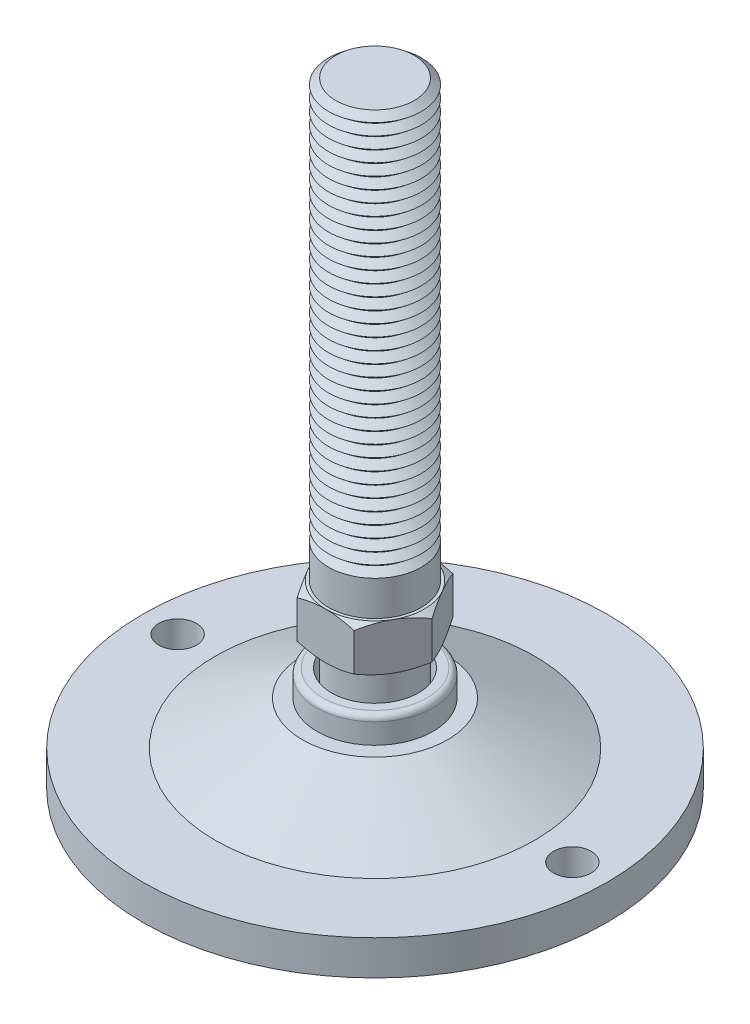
ISO-10303-21;
HEADER;
FILE_DESCRIPTION(('STEP AP214'),'2;1');
FILE_NAME('part.step','',(''),(''),'','','');
FILE_SCHEMA(('AUTOMOTIVE_DESIGN { 1 0 10303 214 1 1 1 1 }'));
ENDSEC;
DATA;
#1=APPLICATION_CONTEXT('core data for automotive mechanical design processes');
#2=APPLICATION_PROTOCOL_DEFINITION('international standard','automotive_design',2000,#1);
#3=PRODUCT_CONTEXT('',#1,'mechanical');
#4=PRODUCT('Part','Part','',(#3));
#5=PRODUCT_RELATED_PRODUCT_CATEGORY('part','',(#4));
#6=PRODUCT_DEFINITION_FORMATION('','',#4);
#7=PRODUCT_DEFINITION_CONTEXT('part definition',#1,'design');
#8=PRODUCT_DEFINITION('design','',#6,#7);
#9=PRODUCT_DEFINITION_SHAPE('','',#8);
#10=(LENGTH_UNIT() NAMED_UNIT(*) SI_UNIT(.MILLI.,.METRE.));
#11=(NAMED_UNIT(*) PLANE_ANGLE_UNIT() SI_UNIT($,.RADIAN.));
#12=(NAMED_UNIT(*) SI_UNIT($,.STERADIAN.) SOLID_ANGLE_UNIT());
#13=UNCERTAINTY_MEASURE_WITH_UNIT(LENGTH_MEASURE(1.E-05),#10,'distance_accuracy_value','');
#14=(GEOMETRIC_REPRESENTATION_CONTEXT(3) GLOBAL_UNCERTAINTY_ASSIGNED_CONTEXT((#13)) GLOBAL_UNIT_ASSIGNED_CONTEXT((#10,
#11,#12)) REPRESENTATION_CONTEXT('',''));
#15=CARTESIAN_POINT('',(0.,0.,0.));
#16=DIRECTION('',(0.,0.,1.));
#17=DIRECTION('',(1.,0.,0.));
#18=AXIS2_PLACEMENT_3D('',#15,#16,#17);
#19=CARTESIAN_POINT('',(0.,98.,0.));
#20=DIRECTION('',(0.,-1.,0.));
#21=DIRECTION('',(0.,0.,-1.));
#22=AXIS2_PLACEMENT_3D('',#19,#20,#21);
#23=CONICAL_SURFACE('',#22,6.75100040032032,0.895664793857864);
#24=CARTESIAN_POINT('',(0.,97.,0.));
#25=DIRECTION('',(0.,-1.,0.));
#26=DIRECTION('',(0.,0.,-1.));
#27=AXIS2_PLACEMENT_3D('',#24,#25,#26);
#28=CIRCLE('',#27,8.);
#29=CARTESIAN_POINT('',(0.,97.,-8.));
#30=VERTEX_POINT('',#29);
#31=EDGE_CURVE('P0_E1378',#30,#30,#28,.T.);
#32=ORIENTED_EDGE('',*,*,#31,.F.);
#33=EDGE_LOOP('',(#32));
#34=FACE_BOUND('',#33,.T.);
#35=CARTESIAN_POINT('',(0.,98.,0.));
#36=DIRECTION('',(0.,-1.,0.));
#37=DIRECTION('',(0.,0.,-1.));
#38=AXIS2_PLACEMENT_3D('',#35,#36,#37);
#39=CIRCLE('',#38,6.75100040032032);
#40=CARTESIAN_POINT('',(0.,98.,-6.75100040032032));
#41=VERTEX_POINT('',#40);
#42=EDGE_CURVE('P0_E1387',#41,#41,#39,.T.);
#43=ORIENTED_EDGE('',*,*,#42,.T.);
#44=EDGE_LOOP('',(#43));
#45=FACE_BOUND('',#44,.T.);
#46=ADVANCED_FACE('P0_F16',(#34,#45),#23,.T.);
#47=CARTESIAN_POINT('',(0.,99.,0.));
#48=DIRECTION('',(0.,1.,0.));
#49=DIRECTION('',(0.,0.,1.));
#50=AXIS2_PLACEMENT_3D('',#47,#48,#49);
#51=CONICAL_SURFACE('',#50,8.,0.895664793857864);
#52=ORIENTED_EDGE('',*,*,#42,.F.);
#53=EDGE_LOOP('',(#52));
#54=FACE_BOUND('',#53,.T.);
#55=CARTESIAN_POINT('',(0.,99.,0.));
#56=DIRECTION('',(0.,-1.,0.));
#57=DIRECTION('',(0.,0.,-1.));
#58=AXIS2_PLACEMENT_3D('',#55,#56,#57);
#59=CIRCLE('',#58,8.);
#60=CARTESIAN_POINT('',(0.,99.,-8.));
#61=VERTEX_POINT('',#60);
#62=EDGE_CURVE('P0_E1384',#61,#61,#59,.T.);
#63=ORIENTED_EDGE('',*,*,#62,.T.);
#64=EDGE_LOOP('',(#63));
#65=FACE_BOUND('',#64,.T.);
#66=ADVANCED_FACE('P0_F308',(#54,#65),#51,.T.);
#67=CARTESIAN_POINT('',(0.,106.,0.));
#68=DIRECTION('',(0.,1.,0.));
#69=DIRECTION('',(0.,0.,1.));
#70=AXIS2_PLACEMENT_3D('',#67,#68,#69);
#71=PLANE('',#70);
#72=CARTESIAN_POINT('',(0.,106.,0.));
#73=DIRECTION('',(0.,-1.,0.));
#74=DIRECTION('',(0.,0.,-1.));
#75=AXIS2_PLACEMENT_3D('',#72,#73,#74);
#76=CIRCLE('',#75,6.75100040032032);
#77=CARTESIAN_POINT('',(0.,106.,-6.75100040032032));
#78=VERTEX_POINT('',#77);
#79=EDGE_CURVE('P0_E143',#78,#78,#76,.T.);
#80=ORIENTED_EDGE('',*,*,#79,.F.);
#81=EDGE_LOOP('',(#80));
#82=FACE_BOUND('',#81,.T.);
#83=ADVANCED_FACE('P0_F314',(#82),#71,.T.);
#84=CARTESIAN_POINT('',(0.,106.,0.));
#85=DIRECTION('',(0.,-1.,0.));
#86=DIRECTION('',(0.,0.,-1.));
#87=AXIS2_PLACEMENT_3D('',#84,#85,#86);
#88=CONICAL_SURFACE('',#87,6.75100040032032,0.895664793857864);
#89=CARTESIAN_POINT('',(0.,105.,0.));
#90=DIRECTION('',(0.,-1.,0.));
#91=DIRECTION('',(0.,0.,-1.));
#92=AXIS2_PLACEMENT_3D('',#89,#90,#91);
#93=CIRCLE('',#92,8.);
#94=CARTESIAN_POINT('',(0.,105.,-8.));
#95=VERTEX_POINT('',#94);
#96=EDGE_CURVE('P0_E353',#95,#95,#93,.T.);
#97=ORIENTED_EDGE('',*,*,#96,.F.);
#98=EDGE_LOOP('',(#97));
#99=FACE_BOUND('',#98,.T.);
#100=ORIENTED_EDGE('',*,*,#79,.T.);
#101=EDGE_LOOP('',(#100));
#102=FACE_BOUND('',#101,.T.);
#103=ADVANCED_FACE('P0_F211',(#99,#102),#88,.T.);
#104=CARTESIAN_POINT('',(0.,105.,0.));
#105=DIRECTION('',(0.,1.,0.));
#106=DIRECTION('',(0.,0.,1.));
#107=AXIS2_PLACEMENT_3D('',#104,#105,#106);
#108=CONICAL_SURFACE('',#107,8.,0.895664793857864);
#109=CARTESIAN_POINT('',(0.,104.,0.));
#110=DIRECTION('',(0.,-1.,0.));
#111=DIRECTION('',(0.,0.,-1.));
#112=AXIS2_PLACEMENT_3D('',#109,#110,#111);
#113=CIRCLE('',#112,6.75100040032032);
#114=CARTESIAN_POINT('',(0.,104.,-6.75100040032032));
#115=VERTEX_POINT('',#114);
#116=EDGE_CURVE('P0_E352',#115,#115,#113,.T.);
#117=ORIENTED_EDGE('',*,*,#116,.F.);
#118=EDGE_LOOP('',(#117));
#119=FACE_BOUND('',#118,.T.);
#120=ORIENTED_EDGE('',*,*,#96,.T.);
#121=EDGE_LOOP('',(#120));
#122=FACE_BOUND('',#121,.T.);
#123=ADVANCED_FACE('P0_F339',(#119,#122),#108,.T.);
#124=CARTESIAN_POINT('',(0.,104.,0.));
#125=DIRECTION('',(0.,-1.,0.));
#126=DIRECTION('',(0.,0.,-1.));
#127=AXIS2_PLACEMENT_3D('',#124,#125,#126);
#128=CONICAL_SURFACE('',#127,6.75100040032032,0.895664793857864);
#129=CARTESIAN_POINT('',(0.,103.,0.));
#130=DIRECTION('',(0.,-1.,0.));
#131=DIRECTION('',(0.,0.,-1.));
#132=AXIS2_PLACEMENT_3D('',#129,#130,#131);
#133=CIRCLE('',#132,8.);
#134=CARTESIAN_POINT('',(0.,103.,-8.));
#135=VERTEX_POINT('',#134);
#136=EDGE_CURVE('P0_E349',#135,#135,#133,.T.);
#137=ORIENTED_EDGE('',*,*,#136,.F.);
#138=EDGE_LOOP('',(#137));
#139=FACE_BOUND('',#138,.T.);
#140=ORIENTED_EDGE('',*,*,#116,.T.);
#141=EDGE_LOOP('',(#140));
#142=FACE_BOUND('',#141,.T.);
#143=ADVANCED_FACE('P0_F334',(#139,#142),#128,.T.);
#144=CARTESIAN_POINT('',(0.,103.,0.));
#145=DIRECTION('',(0.,1.,0.));
#146=DIRECTION('',(0.,0.,1.));
#147=AXIS2_PLACEMENT_3D('',#144,#145,#146);
#148=CONICAL_SURFACE('',#147,8.,0.895664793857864);
#149=CARTESIAN_POINT('',(0.,102.,0.));
#150=DIRECTION('',(0.,-1.,0.));
#151=DIRECTION('',(0.,0.,-1.));
#152=AXIS2_PLACEMENT_3D('',#149,#150,#151);
#153=CIRCLE('',#152,6.75100040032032);
#154=CARTESIAN_POINT('',(0.,102.,-6.75100040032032));
#155=VERTEX_POINT('',#154);
#156=EDGE_CURVE('P0_E358',#155,#155,#153,.T.);
#157=ORIENTED_EDGE('',*,*,#156,.F.);
#158=EDGE_LOOP('',(#157));
#159=FACE_BOUND('',#158,.T.);
#160=ORIENTED_EDGE('',*,*,#136,.T.);
#161=EDGE_LOOP('',(#160));
#162=FACE_BOUND('',#161,.T.);
#163=ADVANCED_FACE('P0_F331',(#159,#162),#148,.T.);
#164=CARTESIAN_POINT('',(0.,102.,0.));
#165=DIRECTION('',(0.,-1.,0.));
#166=DIRECTION('',(0.,0.,-1.));
#167=AXIS2_PLACEMENT_3D('',#164,#165,#166);
#168=CONICAL_SURFACE('',#167,6.75100040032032,0.895664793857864);
#169=CARTESIAN_POINT('',(0.,101.,0.));
#170=DIRECTION('',(0.,-1.,0.));
#171=DIRECTION('',(0.,0.,-1.));
#172=AXIS2_PLACEMENT_3D('',#169,#170,#171);
#173=CIRCLE('',#172,8.);
#174=CARTESIAN_POINT('',(0.,101.,-8.));
#175=VERTEX_POINT('',#174);
#176=EDGE_CURVE('P0_E1390',#175,#175,#173,.T.);
#177=ORIENTED_EDGE('',*,*,#176,.F.);
#178=EDGE_LOOP('',(#177));
#179=FACE_BOUND('',#178,.T.);
#180=ORIENTED_EDGE('',*,*,#156,.T.);
#181=EDGE_LOOP('',(#180));
#182=FACE_BOUND('',#181,.T.);
#183=ADVANCED_FACE('P0_F325',(#179,#182),#168,.T.);
#184=CARTESIAN_POINT('',(0.,101.,0.));
#185=DIRECTION('',(0.,1.,0.));
#186=DIRECTION('',(0.,0.,1.));
#187=AXIS2_PLACEMENT_3D('',#184,#185,#186);
#188=CONICAL_SURFACE('',#187,8.,0.895664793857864);
#189=CARTESIAN_POINT('',(0.,100.,0.));
#190=DIRECTION('',(0.,-1.,0.));
#191=DIRECTION('',(0.,0.,-1.));
#192=AXIS2_PLACEMENT_3D('',#189,#190,#191);
#193=CIRCLE('',#192,6.75100040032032);
#194=CARTESIAN_POINT('',(0.,100.,-6.75100040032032));
#195=VERTEX_POINT('',#194);
#196=EDGE_CURVE('P0_E1393',#195,#195,#193,.T.);
#197=ORIENTED_EDGE('',*,*,#196,.F.);
#198=EDGE_LOOP('',(#197));
#199=FACE_BOUND('',#198,.T.);
#200=ORIENTED_EDGE('',*,*,#176,.T.);
#201=EDGE_LOOP('',(#200));
#202=FACE_BOUND('',#201,.T.);
#203=ADVANCED_FACE('P0_F321',(#199,#202),#188,.T.);
#204=CARTESIAN_POINT('',(0.,100.,0.));
#205=DIRECTION('',(0.,-1.,0.));
#206=DIRECTION('',(0.,0.,-1.));
#207=AXIS2_PLACEMENT_3D('',#204,#205,#206);
#208=CONICAL_SURFACE('',#207,6.75100040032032,0.895664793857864);
#209=ORIENTED_EDGE('',*,*,#62,.F.);
#210=EDGE_LOOP('',(#209));
#211=FACE_BOUND('',#210,.T.);
#212=ORIENTED_EDGE('',*,*,#196,.T.);
#213=EDGE_LOOP('',(#212));
#214=FACE_BOUND('',#213,.T.);
#215=ADVANCED_FACE('P0_F324',(#211,#214),#208,.T.);
#216=CARTESIAN_POINT('',(0.,96.,0.));
#217=DIRECTION('',(0.,-1.,0.));
#218=DIRECTION('',(0.,0.,-1.));
#219=AXIS2_PLACEMENT_3D('',#216,#217,#218);
#220=CONICAL_SURFACE('',#219,6.75100040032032,0.895664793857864);
#221=CARTESIAN_POINT('',(0.,95.,0.));
#222=DIRECTION('',(0.,-1.,0.));
#223=DIRECTION('',(0.,0.,-1.));
#224=AXIS2_PLACEMENT_3D('',#221,#222,#223);
#225=CIRCLE('',#224,8.);
#226=CARTESIAN_POINT('',(0.,95.,-8.));
#227=VERTEX_POINT('',#226);
#228=EDGE_CURVE('P0_E1372',#227,#227,#225,.T.);
#229=ORIENTED_EDGE('',*,*,#228,.F.);
#230=EDGE_LOOP('',(#229));
#231=FACE_BOUND('',#230,.T.);
#232=CARTESIAN_POINT('',(0.,96.,0.));
#233=DIRECTION('',(0.,-1.,0.));
#234=DIRECTION('',(0.,0.,-1.));
#235=AXIS2_PLACEMENT_3D('',#232,#233,#234);
#236=CIRCLE('',#235,6.75100040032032);
#237=CARTESIAN_POINT('',(0.,96.,-6.75100040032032));
#238=VERTEX_POINT('',#237);
#239=EDGE_CURVE('P0_E1381',#238,#238,#236,.T.);
#240=ORIENTED_EDGE('',*,*,#239,.T.);
#241=EDGE_LOOP('',(#240));
#242=FACE_BOUND('',#241,.T.);
#243=ADVANCED_FACE('P0_F329',(#231,#242),#220,.T.);
#244=CARTESIAN_POINT('',(0.,97.,0.));
#245=DIRECTION('',(0.,1.,0.));
#246=DIRECTION('',(0.,0.,1.));
#247=AXIS2_PLACEMENT_3D('',#244,#245,#246);
#248=CONICAL_SURFACE('',#247,8.,0.895664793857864);
#249=ORIENTED_EDGE('',*,*,#239,.F.);
#250=EDGE_LOOP('',(#249));
#251=FACE_BOUND('',#250,.T.);
#252=ORIENTED_EDGE('',*,*,#31,.T.);
#253=EDGE_LOOP('',(#252));
#254=FACE_BOUND('',#253,.T.);
#255=ADVANCED_FACE('P0_F1104',(#251,#254),#248,.T.);
#256=CARTESIAN_POINT('',(0.,94.,0.));
#257=DIRECTION('',(0.,-1.,0.));
#258=DIRECTION('',(0.,0.,-1.));
#259=AXIS2_PLACEMENT_3D('',#256,#257,#258);
#260=CONICAL_SURFACE('',#259,6.75100040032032,0.895664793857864);
#261=CARTESIAN_POINT('',(0.,93.,0.));
#262=DIRECTION('',(0.,-1.,0.));
#263=DIRECTION('',(0.,0.,-1.));
#264=AXIS2_PLACEMENT_3D('',#261,#262,#263);
#265=CIRCLE('',#264,8.);
#266=CARTESIAN_POINT('',(0.,93.,-8.));
#267=VERTEX_POINT('',#266);
#268=EDGE_CURVE('P0_E1366',#267,#267,#265,.T.);
#269=ORIENTED_EDGE('',*,*,#268,.F.);
#270=EDGE_LOOP('',(#269));
#271=FACE_BOUND('',#270,.T.);
#272=CARTESIAN_POINT('',(0.,94.,0.));
#273=DIRECTION('',(0.,-1.,0.));
#274=DIRECTION('',(0.,0.,-1.));
#275=AXIS2_PLACEMENT_3D('',#272,#273,#274);
#276=CIRCLE('',#275,6.75100040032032);
#277=CARTESIAN_POINT('',(0.,94.,-6.75100040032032));
#278=VERTEX_POINT('',#277);
#279=EDGE_CURVE('P0_E1375',#278,#278,#276,.T.);
#280=ORIENTED_EDGE('',*,*,#279,.T.);
#281=EDGE_LOOP('',(#280));
#282=FACE_BOUND('',#281,.T.);
#283=ADVANCED_FACE('P0_F1094',(#271,#282),#260,.T.);
#284=CARTESIAN_POINT('',(0.,95.,0.));
#285=DIRECTION('',(0.,1.,0.));
#286=DIRECTION('',(0.,0.,1.));
#287=AXIS2_PLACEMENT_3D('',#284,#285,#286);
#288=CONICAL_SURFACE('',#287,8.,0.895664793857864);
#289=ORIENTED_EDGE('',*,*,#279,.F.);
#290=EDGE_LOOP('',(#289));
#291=FACE_BOUND('',#290,.T.);
#292=ORIENTED_EDGE('',*,*,#228,.T.);
#293=EDGE_LOOP('',(#292));
#294=FACE_BOUND('',#293,.T.);
#295=ADVANCED_FACE('P0_F1084',(#291,#294),#288,.T.);
#296=CARTESIAN_POINT('',(0.,92.,0.));
#297=DIRECTION('',(0.,-1.,0.));
#298=DIRECTION('',(0.,0.,-1.));
#299=AXIS2_PLACEMENT_3D('',#296,#297,#298);
#300=CONICAL_SURFACE('',#299,6.75100040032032,0.895664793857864);
#301=CARTESIAN_POINT('',(0.,91.,0.));
#302=DIRECTION('',(0.,-1.,0.));
#303=DIRECTION('',(0.,0.,-1.));
#304=AXIS2_PLACEMENT_3D('',#301,#302,#303);
#305=CIRCLE('',#304,8.);
#306=CARTESIAN_POINT('',(0.,91.,-8.));
#307=VERTEX_POINT('',#306);
#308=EDGE_CURVE('P0_E1360',#307,#307,#305,.T.);
#309=ORIENTED_EDGE('',*,*,#308,.F.);
#310=EDGE_LOOP('',(#309));
#311=FACE_BOUND('',#310,.T.);
#312=CARTESIAN_POINT('',(0.,92.,0.));
#313=DIRECTION('',(0.,-1.,0.));
#314=DIRECTION('',(0.,0.,-1.));
#315=AXIS2_PLACEMENT_3D('',#312,#313,#314);
#316=CIRCLE('',#315,6.75100040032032);
#317=CARTESIAN_POINT('',(0.,92.,-6.75100040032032));
#318=VERTEX_POINT('',#317);
#319=EDGE_CURVE('P0_E1369',#318,#318,#316,.T.);
#320=ORIENTED_EDGE('',*,*,#319,.T.);
#321=EDGE_LOOP('',(#320));
#322=FACE_BOUND('',#321,.T.);
#323=ADVANCED_FACE('P0_F1074',(#311,#322),#300,.T.);
#324=CARTESIAN_POINT('',(0.,93.,0.));
#325=DIRECTION('',(0.,1.,0.));
#326=DIRECTION('',(0.,0.,1.));
#327=AXIS2_PLACEMENT_3D('',#324,#325,#326);
#328=CONICAL_SURFACE('',#327,8.,0.895664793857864);
#329=ORIENTED_EDGE('',*,*,#319,.F.);
#330=EDGE_LOOP('',(#329));
#331=FACE_BOUND('',#330,.T.);
#332=ORIENTED_EDGE('',*,*,#268,.T.);
#333=EDGE_LOOP('',(#332));
#334=FACE_BOUND('',#333,.T.);
#335=ADVANCED_FACE('P0_F1064',(#331,#334),#328,.T.);
#336=CARTESIAN_POINT('',(0.,90.,0.));
#337=DIRECTION('',(0.,-1.,0.));
#338=DIRECTION('',(0.,0.,-1.));
#339=AXIS2_PLACEMENT_3D('',#336,#337,#338);
#340=CONICAL_SURFACE('',#339,6.75100040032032,0.895664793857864);
#341=CARTESIAN_POINT('',(0.,89.,0.));
#342=DIRECTION('',(0.,-1.,0.));
#343=DIRECTION('',(0.,0.,-1.));
#344=AXIS2_PLACEMENT_3D('',#341,#342,#343);
#345=CIRCLE('',#344,8.);
#346=CARTESIAN_POINT('',(0.,89.,-8.));
#347=VERTEX_POINT('',#346);
#348=EDGE_CURVE('P0_E1354',#347,#347,#345,.T.);
#349=ORIENTED_EDGE('',*,*,#348,.F.);
#350=EDGE_LOOP('',(#349));
#351=FACE_BOUND('',#350,.T.);
#352=CARTESIAN_POINT('',(0.,90.,0.));
#353=DIRECTION('',(0.,-1.,0.));
#354=DIRECTION('',(0.,0.,-1.));
#355=AXIS2_PLACEMENT_3D('',#352,#353,#354);
#356=CIRCLE('',#355,6.75100040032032);
#357=CARTESIAN_POINT('',(0.,90.,-6.75100040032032));
#358=VERTEX_POINT('',#357);
#359=EDGE_CURVE('P0_E1363',#358,#358,#356,.T.);
#360=ORIENTED_EDGE('',*,*,#359,.T.);
#361=EDGE_LOOP('',(#360));
#362=FACE_BOUND('',#361,.T.);
#363=ADVANCED_FACE('P0_F1054',(#351,#362),#340,.T.);
#364=CARTESIAN_POINT('',(0.,91.,0.));
#365=DIRECTION('',(0.,1.,0.));
#366=DIRECTION('',(0.,0.,1.));
#367=AXIS2_PLACEMENT_3D('',#364,#365,#366);
#368=CONICAL_SURFACE('',#367,8.,0.895664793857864);
#369=ORIENTED_EDGE('',*,*,#359,.F.);
#370=EDGE_LOOP('',(#369));
#371=FACE_BOUND('',#370,.T.);
#372=ORIENTED_EDGE('',*,*,#308,.T.);
#373=EDGE_LOOP('',(#372));
#374=FACE_BOUND('',#373,.T.);
#375=ADVANCED_FACE('P0_F1044',(#371,#374),#368,.T.);
#376=CARTESIAN_POINT('',(0.,88.,0.));
#377=DIRECTION('',(0.,-1.,0.));
#378=DIRECTION('',(0.,0.,-1.));
#379=AXIS2_PLACEMENT_3D('',#376,#377,#378);
#380=CONICAL_SURFACE('',#379,6.75100040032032,0.895664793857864);
#381=CARTESIAN_POINT('',(0.,87.,0.));
#382=DIRECTION('',(0.,-1.,0.));
#383=DIRECTION('',(0.,0.,-1.));
#384=AXIS2_PLACEMENT_3D('',#381,#382,#383);
#385=CIRCLE('',#384,8.);
#386=CARTESIAN_POINT('',(0.,87.,-8.));
#387=VERTEX_POINT('',#386);
#388=EDGE_CURVE('P0_E1348',#387,#387,#385,.T.);
#389=ORIENTED_EDGE('',*,*,#388,.F.);
#390=EDGE_LOOP('',(#389));
#391=FACE_BOUND('',#390,.T.);
#392=CARTESIAN_POINT('',(0.,88.,0.));
#393=DIRECTION('',(0.,-1.,0.));
#394=DIRECTION('',(0.,0.,-1.));
#395=AXIS2_PLACEMENT_3D('',#392,#393,#394);
#396=CIRCLE('',#395,6.75100040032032);
#397=CARTESIAN_POINT('',(0.,88.,-6.75100040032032));
#398=VERTEX_POINT('',#397);
#399=EDGE_CURVE('P0_E1357',#398,#398,#396,.T.);
#400=ORIENTED_EDGE('',*,*,#399,.T.);
#401=EDGE_LOOP('',(#400));
#402=FACE_BOUND('',#401,.T.);
#403=ADVANCED_FACE('P0_F1034',(#391,#402),#380,.T.);
#404=CARTESIAN_POINT('',(0.,89.,0.));
#405=DIRECTION('',(0.,1.,0.));
#406=DIRECTION('',(0.,0.,1.));
#407=AXIS2_PLACEMENT_3D('',#404,#405,#406);
#408=CONICAL_SURFACE('',#407,8.,0.895664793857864);
#409=ORIENTED_EDGE('',*,*,#399,.F.);
#410=EDGE_LOOP('',(#409));
#411=FACE_BOUND('',#410,.T.);
#412=ORIENTED_EDGE('',*,*,#348,.T.);
#413=EDGE_LOOP('',(#412));
#414=FACE_BOUND('',#413,.T.);
#415=ADVANCED_FACE('P0_F1024',(#411,#414),#408,.T.);
#416=CARTESIAN_POINT('',(0.,86.,0.));
#417=DIRECTION('',(0.,-1.,0.));
#418=DIRECTION('',(0.,0.,-1.));
#419=AXIS2_PLACEMENT_3D('',#416,#417,#418);
#420=CONICAL_SURFACE('',#419,6.75100040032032,0.895664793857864);
#421=CARTESIAN_POINT('',(0.,85.,0.));
#422=DIRECTION('',(0.,-1.,0.));
#423=DIRECTION('',(0.,0.,-1.));
#424=AXIS2_PLACEMENT_3D('',#421,#422,#423);
#425=CIRCLE('',#424,8.);
#426=CARTESIAN_POINT('',(0.,85.,-8.));
#427=VERTEX_POINT('',#426);
#428=EDGE_CURVE('P0_E1342',#427,#427,#425,.T.);
#429=ORIENTED_EDGE('',*,*,#428,.F.);
#430=EDGE_LOOP('',(#429));
#431=FACE_BOUND('',#430,.T.);
#432=CARTESIAN_POINT('',(0.,86.,0.));
#433=DIRECTION('',(0.,-1.,0.));
#434=DIRECTION('',(0.,0.,-1.));
#435=AXIS2_PLACEMENT_3D('',#432,#433,#434);
#436=CIRCLE('',#435,6.75100040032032);
#437=CARTESIAN_POINT('',(0.,86.,-6.75100040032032));
#438=VERTEX_POINT('',#437);
#439=EDGE_CURVE('P0_E1351',#438,#438,#436,.T.);
#440=ORIENTED_EDGE('',*,*,#439,.T.);
#441=EDGE_LOOP('',(#440));
#442=FACE_BOUND('',#441,.T.);
#443=ADVANCED_FACE('P0_F1014',(#431,#442),#420,.T.);
#444=CARTESIAN_POINT('',(0.,87.,0.));
#445=DIRECTION('',(0.,1.,0.));
#446=DIRECTION('',(0.,0.,1.));
#447=AXIS2_PLACEMENT_3D('',#444,#445,#446);
#448=CONICAL_SURFACE('',#447,8.,0.895664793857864);
#449=ORIENTED_EDGE('',*,*,#439,.F.);
#450=EDGE_LOOP('',(#449));
#451=FACE_BOUND('',#450,.T.);
#452=ORIENTED_EDGE('',*,*,#388,.T.);
#453=EDGE_LOOP('',(#452));
#454=FACE_BOUND('',#453,.T.);
#455=ADVANCED_FACE('P0_F1004',(#451,#454),#448,.T.);
#456=CARTESIAN_POINT('',(0.,84.,0.));
#457=DIRECTION('',(0.,-1.,0.));
#458=DIRECTION('',(0.,0.,-1.));
#459=AXIS2_PLACEMENT_3D('',#456,#457,#458);
#460=CONICAL_SURFACE('',#459,6.75100040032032,0.895664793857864);
#461=CARTESIAN_POINT('',(0.,83.,0.));
#462=DIRECTION('',(0.,-1.,0.));
#463=DIRECTION('',(0.,0.,-1.));
#464=AXIS2_PLACEMENT_3D('',#461,#462,#463);
#465=CIRCLE('',#464,8.);
#466=CARTESIAN_POINT('',(0.,83.,-8.));
#467=VERTEX_POINT('',#466);
#468=EDGE_CURVE('P0_E1336',#467,#467,#465,.T.);
#469=ORIENTED_EDGE('',*,*,#468,.F.);
#470=EDGE_LOOP('',(#469));
#471=FACE_BOUND('',#470,.T.);
#472=CARTESIAN_POINT('',(0.,84.,0.));
#473=DIRECTION('',(0.,-1.,0.));
#474=DIRECTION('',(0.,0.,-1.));
#475=AXIS2_PLACEMENT_3D('',#472,#473,#474);
#476=CIRCLE('',#475,6.75100040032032);
#477=CARTESIAN_POINT('',(0.,84.,-6.75100040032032));
#478=VERTEX_POINT('',#477);
#479=EDGE_CURVE('P0_E1345',#478,#478,#476,.T.);
#480=ORIENTED_EDGE('',*,*,#479,.T.);
#481=EDGE_LOOP('',(#480));
#482=FACE_BOUND('',#481,.T.);
#483=ADVANCED_FACE('P0_F994',(#471,#482),#460,.T.);
#484=CARTESIAN_POINT('',(0.,85.,0.));
#485=DIRECTION('',(0.,1.,0.));
#486=DIRECTION('',(0.,0.,1.));
#487=AXIS2_PLACEMENT_3D('',#484,#485,#486);
#488=CONICAL_SURFACE('',#487,8.,0.895664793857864);
#489=ORIENTED_EDGE('',*,*,#479,.F.);
#490=EDGE_LOOP('',(#489));
#491=FACE_BOUND('',#490,.T.);
#492=ORIENTED_EDGE('',*,*,#428,.T.);
#493=EDGE_LOOP('',(#492));
#494=FACE_BOUND('',#493,.T.);
#495=ADVANCED_FACE('P0_F984',(#491,#494),#488,.T.);
#496=CARTESIAN_POINT('',(0.,82.,0.));
#497=DIRECTION('',(0.,-1.,0.));
#498=DIRECTION('',(0.,0.,-1.));
#499=AXIS2_PLACEMENT_3D('',#496,#497,#498);
#500=CONICAL_SURFACE('',#499,6.75100040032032,0.895664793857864);
#501=CARTESIAN_POINT('',(0.,81.,0.));
#502=DIRECTION('',(0.,-1.,0.));
#503=DIRECTION('',(0.,0.,-1.));
#504=AXIS2_PLACEMENT_3D('',#501,#502,#503);
#505=CIRCLE('',#504,8.);
#506=CARTESIAN_POINT('',(0.,81.,-8.));
#507=VERTEX_POINT('',#506);
#508=EDGE_CURVE('P0_E1330',#507,#507,#505,.T.);
#509=ORIENTED_EDGE('',*,*,#508,.F.);
#510=EDGE_LOOP('',(#509));
#511=FACE_BOUND('',#510,.T.);
#512=CARTESIAN_POINT('',(0.,82.,0.));
#513=DIRECTION('',(0.,-1.,0.));
#514=DIRECTION('',(0.,0.,-1.));
#515=AXIS2_PLACEMENT_3D('',#512,#513,#514);
#516=CIRCLE('',#515,6.75100040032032);
#517=CARTESIAN_POINT('',(0.,82.,-6.75100040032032));
#518=VERTEX_POINT('',#517);
#519=EDGE_CURVE('P0_E1339',#518,#518,#516,.T.);
#520=ORIENTED_EDGE('',*,*,#519,.T.);
#521=EDGE_LOOP('',(#520));
#522=FACE_BOUND('',#521,.T.);
#523=ADVANCED_FACE('P0_F974',(#511,#522),#500,.T.);
#524=CARTESIAN_POINT('',(0.,83.,0.));
#525=DIRECTION('',(0.,1.,0.));
#526=DIRECTION('',(0.,0.,1.));
#527=AXIS2_PLACEMENT_3D('',#524,#525,#526);
#528=CONICAL_SURFACE('',#527,8.,0.895664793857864);
#529=ORIENTED_EDGE('',*,*,#519,.F.);
#530=EDGE_LOOP('',(#529));
#531=FACE_BOUND('',#530,.T.);
#532=ORIENTED_EDGE('',*,*,#468,.T.);
#533=EDGE_LOOP('',(#532));
#534=FACE_BOUND('',#533,.T.);
#535=ADVANCED_FACE('P0_F964',(#531,#534),#528,.T.);
#536=CARTESIAN_POINT('',(0.,80.,0.));
#537=DIRECTION('',(0.,-1.,0.));
#538=DIRECTION('',(0.,0.,-1.));
#539=AXIS2_PLACEMENT_3D('',#536,#537,#538);
#540=CONICAL_SURFACE('',#539,6.75100040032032,0.895664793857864);
#541=CARTESIAN_POINT('',(0.,79.,0.));
#542=DIRECTION('',(0.,-1.,0.));
#543=DIRECTION('',(0.,0.,-1.));
#544=AXIS2_PLACEMENT_3D('',#541,#542,#543);
#545=CIRCLE('',#544,8.);
#546=CARTESIAN_POINT('',(0.,79.,-8.));
#547=VERTEX_POINT('',#546);
#548=EDGE_CURVE('P0_E1324',#547,#547,#545,.T.);
#549=ORIENTED_EDGE('',*,*,#548,.F.);
#550=EDGE_LOOP('',(#549));
#551=FACE_BOUND('',#550,.T.);
#552=CARTESIAN_POINT('',(0.,80.,0.));
#553=DIRECTION('',(0.,-1.,0.));
#554=DIRECTION('',(0.,0.,-1.));
#555=AXIS2_PLACEMENT_3D('',#552,#553,#554);
#556=CIRCLE('',#555,6.75100040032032);
#557=CARTESIAN_POINT('',(0.,80.,-6.75100040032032));
#558=VERTEX_POINT('',#557);
#559=EDGE_CURVE('P0_E1333',#558,#558,#556,.T.);
#560=ORIENTED_EDGE('',*,*,#559,.T.);
#561=EDGE_LOOP('',(#560));
#562=FACE_BOUND('',#561,.T.);
#563=ADVANCED_FACE('P0_F954',(#551,#562),#540,.T.);
#564=CARTESIAN_POINT('',(0.,81.,0.));
#565=DIRECTION('',(0.,1.,0.));
#566=DIRECTION('',(0.,0.,1.));
#567=AXIS2_PLACEMENT_3D('',#564,#565,#566);
#568=CONICAL_SURFACE('',#567,8.,0.895664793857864);
#569=ORIENTED_EDGE('',*,*,#559,.F.);
#570=EDGE_LOOP('',(#569));
#571=FACE_BOUND('',#570,.T.);
#572=ORIENTED_EDGE('',*,*,#508,.T.);
#573=EDGE_LOOP('',(#572));
#574=FACE_BOUND('',#573,.T.);
#575=ADVANCED_FACE('P0_F944',(#571,#574),#568,.T.);
#576=CARTESIAN_POINT('',(0.,78.,0.));
#577=DIRECTION('',(0.,-1.,0.));
#578=DIRECTION('',(0.,0.,-1.));
#579=AXIS2_PLACEMENT_3D('',#576,#577,#578);
#580=CONICAL_SURFACE('',#579,6.75100040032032,0.895664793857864);
#581=CARTESIAN_POINT('',(0.,77.,0.));
#582=DIRECTION('',(0.,-1.,0.));
#583=DIRECTION('',(0.,0.,-1.));
#584=AXIS2_PLACEMENT_3D('',#581,#582,#583);
#585=CIRCLE('',#584,8.);
#586=CARTESIAN_POINT('',(0.,77.,-8.));
#587=VERTEX_POINT('',#586);
#588=EDGE_CURVE('P0_E1318',#587,#587,#585,.T.);
#589=ORIENTED_EDGE('',*,*,#588,.F.);
#590=EDGE_LOOP('',(#589));
#591=FACE_BOUND('',#590,.T.);
#592=CARTESIAN_POINT('',(0.,78.,0.));
#593=DIRECTION('',(0.,-1.,0.));
#594=DIRECTION('',(0.,0.,-1.));
#595=AXIS2_PLACEMENT_3D('',#592,#593,#594);
#596=CIRCLE('',#595,6.75100040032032);
#597=CARTESIAN_POINT('',(0.,78.,-6.75100040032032));
#598=VERTEX_POINT('',#597);
#599=EDGE_CURVE('P0_E1327',#598,#598,#596,.T.);
#600=ORIENTED_EDGE('',*,*,#599,.T.);
#601=EDGE_LOOP('',(#600));
#602=FACE_BOUND('',#601,.T.);
#603=ADVANCED_FACE('P0_F934',(#591,#602),#580,.T.);
#604=CARTESIAN_POINT('',(0.,79.,0.));
#605=DIRECTION('',(0.,1.,0.));
#606=DIRECTION('',(0.,0.,1.));
#607=AXIS2_PLACEMENT_3D('',#604,#605,#606);
#608=CONICAL_SURFACE('',#607,8.,0.895664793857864);
#609=ORIENTED_EDGE('',*,*,#599,.F.);
#610=EDGE_LOOP('',(#609));
#611=FACE_BOUND('',#610,.T.);
#612=ORIENTED_EDGE('',*,*,#548,.T.);
#613=EDGE_LOOP('',(#612));
#614=FACE_BOUND('',#613,.T.);
#615=ADVANCED_FACE('P0_F924',(#611,#614),#608,.T.);
#616=CARTESIAN_POINT('',(0.,76.,0.));
#617=DIRECTION('',(0.,-1.,0.));
#618=DIRECTION('',(0.,0.,-1.));
#619=AXIS2_PLACEMENT_3D('',#616,#617,#618);
#620=CONICAL_SURFACE('',#619,6.75100040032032,0.895664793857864);
#621=CARTESIAN_POINT('',(0.,75.,0.));
#622=DIRECTION('',(0.,-1.,0.));
#623=DIRECTION('',(0.,0.,-1.));
#624=AXIS2_PLACEMENT_3D('',#621,#622,#623);
#625=CIRCLE('',#624,8.);
#626=CARTESIAN_POINT('',(0.,75.,-8.));
#627=VERTEX_POINT('',#626);
#628=EDGE_CURVE('P0_E1312',#627,#627,#625,.T.);
#629=ORIENTED_EDGE('',*,*,#628,.F.);
#630=EDGE_LOOP('',(#629));
#631=FACE_BOUND('',#630,.T.);
#632=CARTESIAN_POINT('',(0.,76.,0.));
#633=DIRECTION('',(0.,-1.,0.));
#634=DIRECTION('',(0.,0.,-1.));
#635=AXIS2_PLACEMENT_3D('',#632,#633,#634);
#636=CIRCLE('',#635,6.75100040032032);
#637=CARTESIAN_POINT('',(0.,76.,-6.75100040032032));
#638=VERTEX_POINT('',#637);
#639=EDGE_CURVE('P0_E1321',#638,#638,#636,.T.);
#640=ORIENTED_EDGE('',*,*,#639,.T.);
#641=EDGE_LOOP('',(#640));
#642=FACE_BOUND('',#641,.T.);
#643=ADVANCED_FACE('P0_F914',(#631,#642),#620,.T.);
#644=CARTESIAN_POINT('',(0.,77.,0.));
#645=DIRECTION('',(0.,1.,0.));
#646=DIRECTION('',(0.,0.,1.));
#647=AXIS2_PLACEMENT_3D('',#644,#645,#646);
#648=CONICAL_SURFACE('',#647,8.,0.895664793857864);
#649=ORIENTED_EDGE('',*,*,#639,.F.);
#650=EDGE_LOOP('',(#649));
#651=FACE_BOUND('',#650,.T.);
#652=ORIENTED_EDGE('',*,*,#588,.T.);
#653=EDGE_LOOP('',(#652));
#654=FACE_BOUND('',#653,.T.);
#655=ADVANCED_FACE('P0_F904',(#651,#654),#648,.T.);
#656=CARTESIAN_POINT('',(0.,74.,0.));
#657=DIRECTION('',(0.,-1.,0.));
#658=DIRECTION('',(0.,0.,-1.));
#659=AXIS2_PLACEMENT_3D('',#656,#657,#658);
#660=CONICAL_SURFACE('',#659,6.75100040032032,0.895664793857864);
#661=CARTESIAN_POINT('',(0.,73.,0.));
#662=DIRECTION('',(0.,-1.,0.));
#663=DIRECTION('',(0.,0.,-1.));
#664=AXIS2_PLACEMENT_3D('',#661,#662,#663);
#665=CIRCLE('',#664,8.);
#666=CARTESIAN_POINT('',(0.,73.,-8.));
#667=VERTEX_POINT('',#666);
#668=EDGE_CURVE('P0_E1306',#667,#667,#665,.T.);
#669=ORIENTED_EDGE('',*,*,#668,.F.);
#670=EDGE_LOOP('',(#669));
#671=FACE_BOUND('',#670,.T.);
#672=CARTESIAN_POINT('',(0.,74.,0.));
#673=DIRECTION('',(0.,-1.,0.));
#674=DIRECTION('',(0.,0.,-1.));
#675=AXIS2_PLACEMENT_3D('',#672,#673,#674);
#676=CIRCLE('',#675,6.75100040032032);
#677=CARTESIAN_POINT('',(0.,74.,-6.75100040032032));
#678=VERTEX_POINT('',#677);
#679=EDGE_CURVE('P0_E1315',#678,#678,#676,.T.);
#680=ORIENTED_EDGE('',*,*,#679,.T.);
#681=EDGE_LOOP('',(#680));
#682=FACE_BOUND('',#681,.T.);
#683=ADVANCED_FACE('P0_F894',(#671,#682),#660,.T.);
#684=CARTESIAN_POINT('',(0.,75.,0.));
#685=DIRECTION('',(0.,1.,0.));
#686=DIRECTION('',(0.,0.,1.));
#687=AXIS2_PLACEMENT_3D('',#684,#685,#686);
#688=CONICAL_SURFACE('',#687,8.,0.895664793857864);
#689=ORIENTED_EDGE('',*,*,#679,.F.);
#690=EDGE_LOOP('',(#689));
#691=FACE_BOUND('',#690,.T.);
#692=ORIENTED_EDGE('',*,*,#628,.T.);
#693=EDGE_LOOP('',(#692));
#694=FACE_BOUND('',#693,.T.);
#695=ADVANCED_FACE('P0_F884',(#691,#694),#688,.T.);
#696=CARTESIAN_POINT('',(0.,72.,0.));
#697=DIRECTION('',(0.,-1.,0.));
#698=DIRECTION('',(0.,0.,-1.));
#699=AXIS2_PLACEMENT_3D('',#696,#697,#698);
#700=CONICAL_SURFACE('',#699,6.75100040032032,0.895664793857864);
#701=CARTESIAN_POINT('',(0.,71.,0.));
#702=DIRECTION('',(0.,-1.,0.));
#703=DIRECTION('',(0.,0.,-1.));
#704=AXIS2_PLACEMENT_3D('',#701,#702,#703);
#705=CIRCLE('',#704,8.);
#706=CARTESIAN_POINT('',(0.,71.,-8.));
#707=VERTEX_POINT('',#706);
#708=EDGE_CURVE('P0_E1300',#707,#707,#705,.T.);
#709=ORIENTED_EDGE('',*,*,#708,.F.);
#710=EDGE_LOOP('',(#709));
#711=FACE_BOUND('',#710,.T.);
#712=CARTESIAN_POINT('',(0.,72.,0.));
#713=DIRECTION('',(0.,-1.,0.));
#714=DIRECTION('',(0.,0.,-1.));
#715=AXIS2_PLACEMENT_3D('',#712,#713,#714);
#716=CIRCLE('',#715,6.75100040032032);
#717=CARTESIAN_POINT('',(0.,72.,-6.75100040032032));
#718=VERTEX_POINT('',#717);
#719=EDGE_CURVE('P0_E1309',#718,#718,#716,.T.);
#720=ORIENTED_EDGE('',*,*,#719,.T.);
#721=EDGE_LOOP('',(#720));
#722=FACE_BOUND('',#721,.T.);
#723=ADVANCED_FACE('P0_F874',(#711,#722),#700,.T.);
#724=CARTESIAN_POINT('',(0.,73.,0.));
#725=DIRECTION('',(0.,1.,0.));
#726=DIRECTION('',(0.,0.,1.));
#727=AXIS2_PLACEMENT_3D('',#724,#725,#726);
#728=CONICAL_SURFACE('',#727,8.,0.895664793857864);
#729=ORIENTED_EDGE('',*,*,#719,.F.);
#730=EDGE_LOOP('',(#729));
#731=FACE_BOUND('',#730,.T.);
#732=ORIENTED_EDGE('',*,*,#668,.T.);
#733=EDGE_LOOP('',(#732));
#734=FACE_BOUND('',#733,.T.);
#735=ADVANCED_FACE('P0_F864',(#731,#734),#728,.T.);
#736=CARTESIAN_POINT('',(0.,70.,0.));
#737=DIRECTION('',(0.,-1.,0.));
#738=DIRECTION('',(0.,0.,-1.));
#739=AXIS2_PLACEMENT_3D('',#736,#737,#738);
#740=CONICAL_SURFACE('',#739,6.75100040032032,0.895664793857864);
#741=CARTESIAN_POINT('',(0.,69.,0.));
#742=DIRECTION('',(0.,-1.,0.));
#743=DIRECTION('',(0.,0.,-1.));
#744=AXIS2_PLACEMENT_3D('',#741,#742,#743);
#745=CIRCLE('',#744,8.);
#746=CARTESIAN_POINT('',(0.,69.,-8.));
#747=VERTEX_POINT('',#746);
#748=EDGE_CURVE('P0_E1294',#747,#747,#745,.T.);
#749=ORIENTED_EDGE('',*,*,#748,.F.);
#750=EDGE_LOOP('',(#749));
#751=FACE_BOUND('',#750,.T.);
#752=CARTESIAN_POINT('',(0.,70.,0.));
#753=DIRECTION('',(0.,-1.,0.));
#754=DIRECTION('',(0.,0.,-1.));
#755=AXIS2_PLACEMENT_3D('',#752,#753,#754);
#756=CIRCLE('',#755,6.75100040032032);
#757=CARTESIAN_POINT('',(0.,70.,-6.75100040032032));
#758=VERTEX_POINT('',#757);
#759=EDGE_CURVE('P0_E1303',#758,#758,#756,.T.);
#760=ORIENTED_EDGE('',*,*,#759,.T.);
#761=EDGE_LOOP('',(#760));
#762=FACE_BOUND('',#761,.T.);
#763=ADVANCED_FACE('P0_F854',(#751,#762),#740,.T.);
#764=CARTESIAN_POINT('',(0.,71.,0.));
#765=DIRECTION('',(0.,1.,0.));
#766=DIRECTION('',(0.,0.,1.));
#767=AXIS2_PLACEMENT_3D('',#764,#765,#766);
#768=CONICAL_SURFACE('',#767,8.,0.895664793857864);
#769=ORIENTED_EDGE('',*,*,#759,.F.);
#770=EDGE_LOOP('',(#769));
#771=FACE_BOUND('',#770,.T.);
#772=ORIENTED_EDGE('',*,*,#708,.T.);
#773=EDGE_LOOP('',(#772));
#774=FACE_BOUND('',#773,.T.);
#775=ADVANCED_FACE('P0_F844',(#771,#774),#768,.T.);
#776=CARTESIAN_POINT('',(0.,68.,0.));
#777=DIRECTION('',(0.,-1.,0.));
#778=DIRECTION('',(0.,0.,-1.));
#779=AXIS2_PLACEMENT_3D('',#776,#777,#778);
#780=CONICAL_SURFACE('',#779,6.75100040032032,0.895664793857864);
#781=CARTESIAN_POINT('',(0.,67.,0.));
#782=DIRECTION('',(0.,-1.,0.));
#783=DIRECTION('',(0.,0.,-1.));
#784=AXIS2_PLACEMENT_3D('',#781,#782,#783);
#785=CIRCLE('',#784,8.);
#786=CARTESIAN_POINT('',(0.,67.,-8.));
#787=VERTEX_POINT('',#786);
#788=EDGE_CURVE('P0_E1288',#787,#787,#785,.T.);
#789=ORIENTED_EDGE('',*,*,#788,.F.);
#790=EDGE_LOOP('',(#789));
#791=FACE_BOUND('',#790,.T.);
#792=CARTESIAN_POINT('',(0.,68.,0.));
#793=DIRECTION('',(0.,-1.,0.));
#794=DIRECTION('',(0.,0.,-1.));
#795=AXIS2_PLACEMENT_3D('',#792,#793,#794);
#796=CIRCLE('',#795,6.75100040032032);
#797=CARTESIAN_POINT('',(0.,68.,-6.75100040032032));
#798=VERTEX_POINT('',#797);
#799=EDGE_CURVE('P0_E1297',#798,#798,#796,.T.);
#800=ORIENTED_EDGE('',*,*,#799,.T.);
#801=EDGE_LOOP('',(#800));
#802=FACE_BOUND('',#801,.T.);
#803=ADVANCED_FACE('P0_F834',(#791,#802),#780,.T.);
#804=CARTESIAN_POINT('',(0.,69.,0.));
#805=DIRECTION('',(0.,1.,0.));
#806=DIRECTION('',(0.,0.,1.));
#807=AXIS2_PLACEMENT_3D('',#804,#805,#806);
#808=CONICAL_SURFACE('',#807,8.,0.895664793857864);
#809=ORIENTED_EDGE('',*,*,#799,.F.);
#810=EDGE_LOOP('',(#809));
#811=FACE_BOUND('',#810,.T.);
#812=ORIENTED_EDGE('',*,*,#748,.T.);
#813=EDGE_LOOP('',(#812));
#814=FACE_BOUND('',#813,.T.);
#815=ADVANCED_FACE('P0_F824',(#811,#814),#808,.T.);
#816=CARTESIAN_POINT('',(0.,66.,0.));
#817=DIRECTION('',(0.,-1.,0.));
#818=DIRECTION('',(0.,0.,-1.));
#819=AXIS2_PLACEMENT_3D('',#816,#817,#818);
#820=CONICAL_SURFACE('',#819,6.75100040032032,0.895664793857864);
#821=CARTESIAN_POINT('',(0.,65.,0.));
#822=DIRECTION('',(0.,-1.,0.));
#823=DIRECTION('',(0.,0.,-1.));
#824=AXIS2_PLACEMENT_3D('',#821,#822,#823);
#825=CIRCLE('',#824,8.);
#826=CARTESIAN_POINT('',(0.,65.,-8.));
#827=VERTEX_POINT('',#826);
#828=EDGE_CURVE('P0_E1282',#827,#827,#825,.T.);
#829=ORIENTED_EDGE('',*,*,#828,.F.);
#830=EDGE_LOOP('',(#829));
#831=FACE_BOUND('',#830,.T.);
#832=CARTESIAN_POINT('',(0.,66.,0.));
#833=DIRECTION('',(0.,-1.,0.));
#834=DIRECTION('',(0.,0.,-1.));
#835=AXIS2_PLACEMENT_3D('',#832,#833,#834);
#836=CIRCLE('',#835,6.75100040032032);
#837=CARTESIAN_POINT('',(0.,66.,-6.75100040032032));
#838=VERTEX_POINT('',#837);
#839=EDGE_CURVE('P0_E1291',#838,#838,#836,.T.);
#840=ORIENTED_EDGE('',*,*,#839,.T.);
#841=EDGE_LOOP('',(#840));
#842=FACE_BOUND('',#841,.T.);
#843=ADVANCED_FACE('P0_F814',(#831,#842),#820,.T.);
#844=CARTESIAN_POINT('',(0.,67.,0.));
#845=DIRECTION('',(0.,1.,0.));
#846=DIRECTION('',(0.,0.,1.));
#847=AXIS2_PLACEMENT_3D('',#844,#845,#846);
#848=CONICAL_SURFACE('',#847,8.,0.895664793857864);
#849=ORIENTED_EDGE('',*,*,#839,.F.);
#850=EDGE_LOOP('',(#849));
#851=FACE_BOUND('',#850,.T.);
#852=ORIENTED_EDGE('',*,*,#788,.T.);
#853=EDGE_LOOP('',(#852));
#854=FACE_BOUND('',#853,.T.);
#855=ADVANCED_FACE('P0_F804',(#851,#854),#848,.T.);
#856=CARTESIAN_POINT('',(0.,64.,0.));
#857=DIRECTION('',(0.,-1.,0.));
#858=DIRECTION('',(0.,0.,-1.));
#859=AXIS2_PLACEMENT_3D('',#856,#857,#858);
#860=CONICAL_SURFACE('',#859,6.75100040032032,0.895664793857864);
#861=CARTESIAN_POINT('',(0.,63.,0.));
#862=DIRECTION('',(0.,-1.,0.));
#863=DIRECTION('',(0.,0.,-1.));
#864=AXIS2_PLACEMENT_3D('',#861,#862,#863);
#865=CIRCLE('',#864,8.);
#866=CARTESIAN_POINT('',(0.,63.,-8.));
#867=VERTEX_POINT('',#866);
#868=EDGE_CURVE('P0_E1276',#867,#867,#865,.T.);
#869=ORIENTED_EDGE('',*,*,#868,.F.);
#870=EDGE_LOOP('',(#869));
#871=FACE_BOUND('',#870,.T.);
#872=CARTESIAN_POINT('',(0.,64.,0.));
#873=DIRECTION('',(0.,-1.,0.));
#874=DIRECTION('',(0.,0.,-1.));
#875=AXIS2_PLACEMENT_3D('',#872,#873,#874);
#876=CIRCLE('',#875,6.75100040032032);
#877=CARTESIAN_POINT('',(0.,64.,-6.75100040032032));
#878=VERTEX_POINT('',#877);
#879=EDGE_CURVE('P0_E1285',#878,#878,#876,.T.);
#880=ORIENTED_EDGE('',*,*,#879,.T.);
#881=EDGE_LOOP('',(#880));
#882=FACE_BOUND('',#881,.T.);
#883=ADVANCED_FACE('P0_F794',(#871,#882),#860,.T.);
#884=CARTESIAN_POINT('',(0.,65.,0.));
#885=DIRECTION('',(0.,1.,0.));
#886=DIRECTION('',(0.,0.,1.));
#887=AXIS2_PLACEMENT_3D('',#884,#885,#886);
#888=CONICAL_SURFACE('',#887,8.,0.895664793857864);
#889=ORIENTED_EDGE('',*,*,#879,.F.);
#890=EDGE_LOOP('',(#889));
#891=FACE_BOUND('',#890,.T.);
#892=ORIENTED_EDGE('',*,*,#828,.T.);
#893=EDGE_LOOP('',(#892));
#894=FACE_BOUND('',#893,.T.);
#895=ADVANCED_FACE('P0_F784',(#891,#894),#888,.T.);
#896=CARTESIAN_POINT('',(0.,62.,0.));
#897=DIRECTION('',(0.,-1.,0.));
#898=DIRECTION('',(0.,0.,-1.));
#899=AXIS2_PLACEMENT_3D('',#896,#897,#898);
#900=CONICAL_SURFACE('',#899,6.75100040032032,0.895664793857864);
#901=CARTESIAN_POINT('',(0.,61.,0.));
#902=DIRECTION('',(0.,-1.,0.));
#903=DIRECTION('',(0.,0.,-1.));
#904=AXIS2_PLACEMENT_3D('',#901,#902,#903);
#905=CIRCLE('',#904,8.);
#906=CARTESIAN_POINT('',(0.,61.,-8.));
#907=VERTEX_POINT('',#906);
#908=EDGE_CURVE('P0_E1270',#907,#907,#905,.T.);
#909=ORIENTED_EDGE('',*,*,#908,.F.);
#910=EDGE_LOOP('',(#909));
#911=FACE_BOUND('',#910,.T.);
#912=CARTESIAN_POINT('',(0.,62.,0.));
#913=DIRECTION('',(0.,-1.,0.));
#914=DIRECTION('',(0.,0.,-1.));
#915=AXIS2_PLACEMENT_3D('',#912,#913,#914);
#916=CIRCLE('',#915,6.75100040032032);
#917=CARTESIAN_POINT('',(0.,62.,-6.75100040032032));
#918=VERTEX_POINT('',#917);
#919=EDGE_CURVE('P0_E1279',#918,#918,#916,.T.);
#920=ORIENTED_EDGE('',*,*,#919,.T.);
#921=EDGE_LOOP('',(#920));
#922=FACE_BOUND('',#921,.T.);
#923=ADVANCED_FACE('P0_F774',(#911,#922),#900,.T.);
#924=CARTESIAN_POINT('',(0.,63.,0.));
#925=DIRECTION('',(0.,1.,0.));
#926=DIRECTION('',(0.,0.,1.));
#927=AXIS2_PLACEMENT_3D('',#924,#925,#926);
#928=CONICAL_SURFACE('',#927,8.,0.895664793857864);
#929=ORIENTED_EDGE('',*,*,#919,.F.);
#930=EDGE_LOOP('',(#929));
#931=FACE_BOUND('',#930,.T.);
#932=ORIENTED_EDGE('',*,*,#868,.T.);
#933=EDGE_LOOP('',(#932));
#934=FACE_BOUND('',#933,.T.);
#935=ADVANCED_FACE('P0_F764',(#931,#934),#928,.T.);
#936=CARTESIAN_POINT('',(0.,60.,0.));
#937=DIRECTION('',(0.,-1.,0.));
#938=DIRECTION('',(0.,0.,-1.));
#939=AXIS2_PLACEMENT_3D('',#936,#937,#938);
#940=CONICAL_SURFACE('',#939,6.75100040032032,0.895664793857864);
#941=CARTESIAN_POINT('',(0.,59.,0.));
#942=DIRECTION('',(0.,-1.,0.));
#943=DIRECTION('',(0.,0.,-1.));
#944=AXIS2_PLACEMENT_3D('',#941,#942,#943);
#945=CIRCLE('',#944,8.);
#946=CARTESIAN_POINT('',(0.,59.,-8.));
#947=VERTEX_POINT('',#946);
#948=EDGE_CURVE('P0_E1264',#947,#947,#945,.T.);
#949=ORIENTED_EDGE('',*,*,#948,.F.);
#950=EDGE_LOOP('',(#949));
#951=FACE_BOUND('',#950,.T.);
#952=CARTESIAN_POINT('',(0.,60.,0.));
#953=DIRECTION('',(0.,-1.,0.));
#954=DIRECTION('',(0.,0.,-1.));
#955=AXIS2_PLACEMENT_3D('',#952,#953,#954);
#956=CIRCLE('',#955,6.75100040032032);
#957=CARTESIAN_POINT('',(0.,60.,-6.75100040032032));
#958=VERTEX_POINT('',#957);
#959=EDGE_CURVE('P0_E1273',#958,#958,#956,.T.);
#960=ORIENTED_EDGE('',*,*,#959,.T.);
#961=EDGE_LOOP('',(#960));
#962=FACE_BOUND('',#961,.T.);
#963=ADVANCED_FACE('P0_F754',(#951,#962),#940,.T.);
#964=CARTESIAN_POINT('',(0.,61.,0.));
#965=DIRECTION('',(0.,1.,0.));
#966=DIRECTION('',(0.,0.,1.));
#967=AXIS2_PLACEMENT_3D('',#964,#965,#966);
#968=CONICAL_SURFACE('',#967,8.,0.895664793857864);
#969=ORIENTED_EDGE('',*,*,#959,.F.);
#970=EDGE_LOOP('',(#969));
#971=FACE_BOUND('',#970,.T.);
#972=ORIENTED_EDGE('',*,*,#908,.T.);
#973=EDGE_LOOP('',(#972));
#974=FACE_BOUND('',#973,.T.);
#975=ADVANCED_FACE('P0_F744',(#971,#974),#968,.T.);
#976=CARTESIAN_POINT('',(0.,58.,0.));
#977=DIRECTION('',(0.,-1.,0.));
#978=DIRECTION('',(0.,0.,-1.));
#979=AXIS2_PLACEMENT_3D('',#976,#977,#978);
#980=CONICAL_SURFACE('',#979,6.75100040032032,0.895664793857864);
#981=CARTESIAN_POINT('',(0.,57.,0.));
#982=DIRECTION('',(0.,-1.,0.));
#983=DIRECTION('',(0.,0.,-1.));
#984=AXIS2_PLACEMENT_3D('',#981,#982,#983);
#985=CIRCLE('',#984,8.);
#986=CARTESIAN_POINT('',(0.,57.,-8.));
#987=VERTEX_POINT('',#986);
#988=EDGE_CURVE('P0_E1258',#987,#987,#985,.T.);
#989=ORIENTED_EDGE('',*,*,#988,.F.);
#990=EDGE_LOOP('',(#989));
#991=FACE_BOUND('',#990,.T.);
#992=CARTESIAN_POINT('',(0.,58.,0.));
#993=DIRECTION('',(0.,-1.,0.));
#994=DIRECTION('',(0.,0.,-1.));
#995=AXIS2_PLACEMENT_3D('',#992,#993,#994);
#996=CIRCLE('',#995,6.75100040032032);
#997=CARTESIAN_POINT('',(0.,58.,-6.75100040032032));
#998=VERTEX_POINT('',#997);
#999=EDGE_CURVE('P0_E1267',#998,#998,#996,.T.);
#1000=ORIENTED_EDGE('',*,*,#999,.T.);
#1001=EDGE_LOOP('',(#1000));
#1002=FACE_BOUND('',#1001,.T.);
#1003=ADVANCED_FACE('P0_F734',(#991,#1002),#980,.T.);
#1004=CARTESIAN_POINT('',(0.,59.,0.));
#1005=DIRECTION('',(0.,1.,0.));
#1006=DIRECTION('',(0.,0.,1.));
#1007=AXIS2_PLACEMENT_3D('',#1004,#1005,#1006);
#1008=CONICAL_SURFACE('',#1007,8.,0.895664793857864);
#1009=ORIENTED_EDGE('',*,*,#999,.F.);
#1010=EDGE_LOOP('',(#1009));
#1011=FACE_BOUND('',#1010,.T.);
#1012=ORIENTED_EDGE('',*,*,#948,.T.);
#1013=EDGE_LOOP('',(#1012));
#1014=FACE_BOUND('',#1013,.T.);
#1015=ADVANCED_FACE('P0_F724',(#1011,#1014),#1008,.T.);
#1016=CARTESIAN_POINT('',(0.,56.,0.));
#1017=DIRECTION('',(0.,-1.,0.));
#1018=DIRECTION('',(0.,0.,-1.));
#1019=AXIS2_PLACEMENT_3D('',#1016,#1017,#1018);
#1020=CONICAL_SURFACE('',#1019,6.75100040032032,0.895664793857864);
#1021=CARTESIAN_POINT('',(0.,55.,0.));
#1022=DIRECTION('',(0.,-1.,0.));
#1023=DIRECTION('',(0.,0.,-1.));
#1024=AXIS2_PLACEMENT_3D('',#1021,#1022,#1023);
#1025=CIRCLE('',#1024,8.);
#1026=CARTESIAN_POINT('',(0.,55.,-8.));
#1027=VERTEX_POINT('',#1026);
#1028=EDGE_CURVE('P0_E1252',#1027,#1027,#1025,.T.);
#1029=ORIENTED_EDGE('',*,*,#1028,.F.);
#1030=EDGE_LOOP('',(#1029));
#1031=FACE_BOUND('',#1030,.T.);
#1032=CARTESIAN_POINT('',(0.,56.,0.));
#1033=DIRECTION('',(0.,-1.,0.));
#1034=DIRECTION('',(0.,0.,-1.));
#1035=AXIS2_PLACEMENT_3D('',#1032,#1033,#1034);
#1036=CIRCLE('',#1035,6.75100040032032);
#1037=CARTESIAN_POINT('',(0.,56.,-6.75100040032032));
#1038=VERTEX_POINT('',#1037);
#1039=EDGE_CURVE('P0_E1261',#1038,#1038,#1036,.T.);
#1040=ORIENTED_EDGE('',*,*,#1039,.T.);
#1041=EDGE_LOOP('',(#1040));
#1042=FACE_BOUND('',#1041,.T.);
#1043=ADVANCED_FACE('P0_F714',(#1031,#1042),#1020,.T.);
#1044=CARTESIAN_POINT('',(0.,57.,0.));
#1045=DIRECTION('',(0.,1.,0.));
#1046=DIRECTION('',(0.,0.,1.));
#1047=AXIS2_PLACEMENT_3D('',#1044,#1045,#1046);
#1048=CONICAL_SURFACE('',#1047,8.,0.895664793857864);
#1049=ORIENTED_EDGE('',*,*,#1039,.F.);
#1050=EDGE_LOOP('',(#1049));
#1051=FACE_BOUND('',#1050,.T.);
#1052=ORIENTED_EDGE('',*,*,#988,.T.);
#1053=EDGE_LOOP('',(#1052));
#1054=FACE_BOUND('',#1053,.T.);
#1055=ADVANCED_FACE('P0_F704',(#1051,#1054),#1048,.T.);
#1056=CARTESIAN_POINT('',(0.,54.,0.));
#1057=DIRECTION('',(0.,-1.,0.));
#1058=DIRECTION('',(0.,0.,-1.));
#1059=AXIS2_PLACEMENT_3D('',#1056,#1057,#1058);
#1060=CONICAL_SURFACE('',#1059,6.75100040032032,0.895664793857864);
#1061=CARTESIAN_POINT('',(0.,53.,0.));
#1062=DIRECTION('',(0.,-1.,0.));
#1063=DIRECTION('',(0.,0.,-1.));
#1064=AXIS2_PLACEMENT_3D('',#1061,#1062,#1063);
#1065=CIRCLE('',#1064,8.);
#1066=CARTESIAN_POINT('',(0.,53.,-8.));
#1067=VERTEX_POINT('',#1066);
#1068=EDGE_CURVE('P0_E1246',#1067,#1067,#1065,.T.);
#1069=ORIENTED_EDGE('',*,*,#1068,.F.);
#1070=EDGE_LOOP('',(#1069));
#1071=FACE_BOUND('',#1070,.T.);
#1072=CARTESIAN_POINT('',(0.,54.,0.));
#1073=DIRECTION('',(0.,-1.,0.));
#1074=DIRECTION('',(0.,0.,-1.));
#1075=AXIS2_PLACEMENT_3D('',#1072,#1073,#1074);
#1076=CIRCLE('',#1075,6.75100040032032);
#1077=CARTESIAN_POINT('',(0.,54.,-6.75100040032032));
#1078=VERTEX_POINT('',#1077);
#1079=EDGE_CURVE('P0_E1255',#1078,#1078,#1076,.T.);
#1080=ORIENTED_EDGE('',*,*,#1079,.T.);
#1081=EDGE_LOOP('',(#1080));
#1082=FACE_BOUND('',#1081,.T.);
#1083=ADVANCED_FACE('P0_F694',(#1071,#1082),#1060,.T.);
#1084=CARTESIAN_POINT('',(0.,55.,0.));
#1085=DIRECTION('',(0.,1.,0.));
#1086=DIRECTION('',(0.,0.,1.));
#1087=AXIS2_PLACEMENT_3D('',#1084,#1085,#1086);
#1088=CONICAL_SURFACE('',#1087,8.,0.895664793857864);
#1089=ORIENTED_EDGE('',*,*,#1079,.F.);
#1090=EDGE_LOOP('',(#1089));
#1091=FACE_BOUND('',#1090,.T.);
#1092=ORIENTED_EDGE('',*,*,#1028,.T.);
#1093=EDGE_LOOP('',(#1092));
#1094=FACE_BOUND('',#1093,.T.);
#1095=ADVANCED_FACE('P0_F684',(#1091,#1094),#1088,.T.);
#1096=CARTESIAN_POINT('',(0.,52.,0.));
#1097=DIRECTION('',(0.,-1.,0.));
#1098=DIRECTION('',(0.,0.,-1.));
#1099=AXIS2_PLACEMENT_3D('',#1096,#1097,#1098);
#1100=CONICAL_SURFACE('',#1099,6.75100040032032,0.895664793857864);
#1101=CARTESIAN_POINT('',(0.,51.,0.));
#1102=DIRECTION('',(0.,-1.,0.));
#1103=DIRECTION('',(0.,0.,-1.));
#1104=AXIS2_PLACEMENT_3D('',#1101,#1102,#1103);
#1105=CIRCLE('',#1104,8.);
#1106=CARTESIAN_POINT('',(0.,51.,-8.));
#1107=VERTEX_POINT('',#1106);
#1108=EDGE_CURVE('P0_E1240',#1107,#1107,#1105,.T.);
#1109=ORIENTED_EDGE('',*,*,#1108,.F.);
#1110=EDGE_LOOP('',(#1109));
#1111=FACE_BOUND('',#1110,.T.);
#1112=CARTESIAN_POINT('',(0.,52.,0.));
#1113=DIRECTION('',(0.,-1.,0.));
#1114=DIRECTION('',(0.,0.,-1.));
#1115=AXIS2_PLACEMENT_3D('',#1112,#1113,#1114);
#1116=CIRCLE('',#1115,6.75100040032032);
#1117=CARTESIAN_POINT('',(0.,52.,-6.75100040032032));
#1118=VERTEX_POINT('',#1117);
#1119=EDGE_CURVE('P0_E1249',#1118,#1118,#1116,.T.);
#1120=ORIENTED_EDGE('',*,*,#1119,.T.);
#1121=EDGE_LOOP('',(#1120));
#1122=FACE_BOUND('',#1121,.T.);
#1123=ADVANCED_FACE('P0_F674',(#1111,#1122),#1100,.T.);
#1124=CARTESIAN_POINT('',(0.,53.,0.));
#1125=DIRECTION('',(0.,1.,0.));
#1126=DIRECTION('',(0.,0.,1.));
#1127=AXIS2_PLACEMENT_3D('',#1124,#1125,#1126);
#1128=CONICAL_SURFACE('',#1127,8.,0.895664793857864);
#1129=ORIENTED_EDGE('',*,*,#1119,.F.);
#1130=EDGE_LOOP('',(#1129));
#1131=FACE_BOUND('',#1130,.T.);
#1132=ORIENTED_EDGE('',*,*,#1068,.T.);
#1133=EDGE_LOOP('',(#1132));
#1134=FACE_BOUND('',#1133,.T.);
#1135=ADVANCED_FACE('P0_F664',(#1131,#1134),#1128,.T.);
#1136=CARTESIAN_POINT('',(0.,50.,0.));
#1137=DIRECTION('',(0.,-1.,0.));
#1138=DIRECTION('',(0.,0.,-1.));
#1139=AXIS2_PLACEMENT_3D('',#1136,#1137,#1138);
#1140=CONICAL_SURFACE('',#1139,6.75100040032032,0.895664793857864);
#1141=CARTESIAN_POINT('',(0.,49.,0.));
#1142=DIRECTION('',(0.,-1.,0.));
#1143=DIRECTION('',(0.,0.,-1.));
#1144=AXIS2_PLACEMENT_3D('',#1141,#1142,#1143);
#1145=CIRCLE('',#1144,8.);
#1146=CARTESIAN_POINT('',(0.,49.,-8.));
#1147=VERTEX_POINT('',#1146);
#1148=EDGE_CURVE('P0_E1234',#1147,#1147,#1145,.T.);
#1149=ORIENTED_EDGE('',*,*,#1148,.F.);
#1150=EDGE_LOOP('',(#1149));
#1151=FACE_BOUND('',#1150,.T.);
#1152=CARTESIAN_POINT('',(0.,50.,0.));
#1153=DIRECTION('',(0.,-1.,0.));
#1154=DIRECTION('',(0.,0.,-1.));
#1155=AXIS2_PLACEMENT_3D('',#1152,#1153,#1154);
#1156=CIRCLE('',#1155,6.75100040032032);
#1157=CARTESIAN_POINT('',(0.,50.,-6.75100040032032));
#1158=VERTEX_POINT('',#1157);
#1159=EDGE_CURVE('P0_E1243',#1158,#1158,#1156,.T.);
#1160=ORIENTED_EDGE('',*,*,#1159,.T.);
#1161=EDGE_LOOP('',(#1160));
#1162=FACE_BOUND('',#1161,.T.);
#1163=ADVANCED_FACE('P0_F654',(#1151,#1162),#1140,.T.);
#1164=CARTESIAN_POINT('',(0.,51.,0.));
#1165=DIRECTION('',(0.,1.,0.));
#1166=DIRECTION('',(0.,0.,1.));
#1167=AXIS2_PLACEMENT_3D('',#1164,#1165,#1166);
#1168=CONICAL_SURFACE('',#1167,8.,0.895664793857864);
#1169=ORIENTED_EDGE('',*,*,#1159,.F.);
#1170=EDGE_LOOP('',(#1169));
#1171=FACE_BOUND('',#1170,.T.);
#1172=ORIENTED_EDGE('',*,*,#1108,.T.);
#1173=EDGE_LOOP('',(#1172));
#1174=FACE_BOUND('',#1173,.T.);
#1175=ADVANCED_FACE('P0_F644',(#1171,#1174),#1168,.T.);
#1176=CARTESIAN_POINT('',(0.,48.,0.));
#1177=DIRECTION('',(0.,-1.,0.));
#1178=DIRECTION('',(0.,0.,-1.));
#1179=AXIS2_PLACEMENT_3D('',#1176,#1177,#1178);
#1180=CONICAL_SURFACE('',#1179,6.75100040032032,0.895664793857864);
#1181=CARTESIAN_POINT('',(0.,47.,0.));
#1182=DIRECTION('',(0.,-1.,0.));
#1183=DIRECTION('',(0.,0.,-1.));
#1184=AXIS2_PLACEMENT_3D('',#1181,#1182,#1183);
#1185=CIRCLE('',#1184,8.);
#1186=CARTESIAN_POINT('',(0.,47.,-8.));
#1187=VERTEX_POINT('',#1186);
#1188=EDGE_CURVE('P0_E1228',#1187,#1187,#1185,.T.);
#1189=ORIENTED_EDGE('',*,*,#1188,.F.);
#1190=EDGE_LOOP('',(#1189));
#1191=FACE_BOUND('',#1190,.T.);
#1192=CARTESIAN_POINT('',(0.,48.,0.));
#1193=DIRECTION('',(0.,-1.,0.));
#1194=DIRECTION('',(0.,0.,-1.));
#1195=AXIS2_PLACEMENT_3D('',#1192,#1193,#1194);
#1196=CIRCLE('',#1195,6.75100040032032);
#1197=CARTESIAN_POINT('',(0.,48.,-6.75100040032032));
#1198=VERTEX_POINT('',#1197);
#1199=EDGE_CURVE('P0_E1237',#1198,#1198,#1196,.T.);
#1200=ORIENTED_EDGE('',*,*,#1199,.T.);
#1201=EDGE_LOOP('',(#1200));
#1202=FACE_BOUND('',#1201,.T.);
#1203=ADVANCED_FACE('P0_F634',(#1191,#1202),#1180,.T.);
#1204=CARTESIAN_POINT('',(0.,49.,0.));
#1205=DIRECTION('',(0.,1.,0.));
#1206=DIRECTION('',(0.,0.,1.));
#1207=AXIS2_PLACEMENT_3D('',#1204,#1205,#1206);
#1208=CONICAL_SURFACE('',#1207,8.,0.895664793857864);
#1209=ORIENTED_EDGE('',*,*,#1199,.F.);
#1210=EDGE_LOOP('',(#1209));
#1211=FACE_BOUND('',#1210,.T.);
#1212=ORIENTED_EDGE('',*,*,#1148,.T.);
#1213=EDGE_LOOP('',(#1212));
#1214=FACE_BOUND('',#1213,.T.);
#1215=ADVANCED_FACE('P0_F624',(#1211,#1214),#1208,.T.);
#1216=CARTESIAN_POINT('',(0.,46.,0.));
#1217=DIRECTION('',(0.,-1.,0.));
#1218=DIRECTION('',(0.,0.,-1.));
#1219=AXIS2_PLACEMENT_3D('',#1216,#1217,#1218);
#1220=CONICAL_SURFACE('',#1219,6.75100040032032,0.895664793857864);
#1221=CARTESIAN_POINT('',(0.,45.,0.));
#1222=DIRECTION('',(0.,-1.,0.));
#1223=DIRECTION('',(0.,0.,-1.));
#1224=AXIS2_PLACEMENT_3D('',#1221,#1222,#1223);
#1225=CIRCLE('',#1224,8.);
#1226=CARTESIAN_POINT('',(0.,45.,-8.));
#1227=VERTEX_POINT('',#1226);
#1228=EDGE_CURVE('P0_E1222',#1227,#1227,#1225,.T.);
#1229=ORIENTED_EDGE('',*,*,#1228,.F.);
#1230=EDGE_LOOP('',(#1229));
#1231=FACE_BOUND('',#1230,.T.);
#1232=CARTESIAN_POINT('',(0.,46.,0.));
#1233=DIRECTION('',(0.,-1.,0.));
#1234=DIRECTION('',(0.,0.,-1.));
#1235=AXIS2_PLACEMENT_3D('',#1232,#1233,#1234);
#1236=CIRCLE('',#1235,6.75100040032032);
#1237=CARTESIAN_POINT('',(0.,46.,-6.75100040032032));
#1238=VERTEX_POINT('',#1237);
#1239=EDGE_CURVE('P0_E1231',#1238,#1238,#1236,.T.);
#1240=ORIENTED_EDGE('',*,*,#1239,.T.);
#1241=EDGE_LOOP('',(#1240));
#1242=FACE_BOUND('',#1241,.T.);
#1243=ADVANCED_FACE('P0_F614',(#1231,#1242),#1220,.T.);
#1244=CARTESIAN_POINT('',(0.,47.,0.));
#1245=DIRECTION('',(0.,1.,0.));
#1246=DIRECTION('',(0.,0.,1.));
#1247=AXIS2_PLACEMENT_3D('',#1244,#1245,#1246);
#1248=CONICAL_SURFACE('',#1247,8.,0.895664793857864);
#1249=ORIENTED_EDGE('',*,*,#1239,.F.);
#1250=EDGE_LOOP('',(#1249));
#1251=FACE_BOUND('',#1250,.T.);
#1252=ORIENTED_EDGE('',*,*,#1188,.T.);
#1253=EDGE_LOOP('',(#1252));
#1254=FACE_BOUND('',#1253,.T.);
#1255=ADVANCED_FACE('P0_F604',(#1251,#1254),#1248,.T.);
#1256=CARTESIAN_POINT('',(0.,44.,0.));
#1257=DIRECTION('',(0.,-1.,0.));
#1258=DIRECTION('',(0.,0.,-1.));
#1259=AXIS2_PLACEMENT_3D('',#1256,#1257,#1258);
#1260=CONICAL_SURFACE('',#1259,6.75100040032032,0.895664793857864);
#1261=CARTESIAN_POINT('',(0.,43.,0.));
#1262=DIRECTION('',(0.,-1.,0.));
#1263=DIRECTION('',(0.,0.,-1.));
#1264=AXIS2_PLACEMENT_3D('',#1261,#1262,#1263);
#1265=CIRCLE('',#1264,8.);
#1266=CARTESIAN_POINT('',(0.,43.,-8.));
#1267=VERTEX_POINT('',#1266);
#1268=EDGE_CURVE('P0_E1216',#1267,#1267,#1265,.T.);
#1269=ORIENTED_EDGE('',*,*,#1268,.F.);
#1270=EDGE_LOOP('',(#1269));
#1271=FACE_BOUND('',#1270,.T.);
#1272=CARTESIAN_POINT('',(0.,44.,0.));
#1273=DIRECTION('',(0.,-1.,0.));
#1274=DIRECTION('',(0.,0.,-1.));
#1275=AXIS2_PLACEMENT_3D('',#1272,#1273,#1274);
#1276=CIRCLE('',#1275,6.75100040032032);
#1277=CARTESIAN_POINT('',(0.,44.,-6.75100040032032));
#1278=VERTEX_POINT('',#1277);
#1279=EDGE_CURVE('P0_E1225',#1278,#1278,#1276,.T.);
#1280=ORIENTED_EDGE('',*,*,#1279,.T.);
#1281=EDGE_LOOP('',(#1280));
#1282=FACE_BOUND('',#1281,.T.);
#1283=ADVANCED_FACE('P0_F594',(#1271,#1282),#1260,.T.);
#1284=CARTESIAN_POINT('',(0.,45.,0.));
#1285=DIRECTION('',(0.,1.,0.));
#1286=DIRECTION('',(0.,0.,1.));
#1287=AXIS2_PLACEMENT_3D('',#1284,#1285,#1286);
#1288=CONICAL_SURFACE('',#1287,8.,0.895664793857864);
#1289=ORIENTED_EDGE('',*,*,#1279,.F.);
#1290=EDGE_LOOP('',(#1289));
#1291=FACE_BOUND('',#1290,.T.);
#1292=ORIENTED_EDGE('',*,*,#1228,.T.);
#1293=EDGE_LOOP('',(#1292));
#1294=FACE_BOUND('',#1293,.T.);
#1295=ADVANCED_FACE('P0_F584',(#1291,#1294),#1288,.T.);
#1296=CARTESIAN_POINT('',(0.,42.,0.));
#1297=DIRECTION('',(0.,-1.,0.));
#1298=DIRECTION('',(0.,0.,-1.));
#1299=AXIS2_PLACEMENT_3D('',#1296,#1297,#1298);
#1300=CONICAL_SURFACE('',#1299,6.75100040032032,0.895664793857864);
#1301=CARTESIAN_POINT('',(0.,41.,0.));
#1302=DIRECTION('',(0.,-1.,0.));
#1303=DIRECTION('',(0.,0.,-1.));
#1304=AXIS2_PLACEMENT_3D('',#1301,#1302,#1303);
#1305=CIRCLE('',#1304,8.);
#1306=CARTESIAN_POINT('',(0.,41.,-8.));
#1307=VERTEX_POINT('',#1306);
#1308=EDGE_CURVE('P0_E1210',#1307,#1307,#1305,.T.);
#1309=ORIENTED_EDGE('',*,*,#1308,.F.);
#1310=EDGE_LOOP('',(#1309));
#1311=FACE_BOUND('',#1310,.T.);
#1312=CARTESIAN_POINT('',(0.,42.,0.));
#1313=DIRECTION('',(0.,-1.,0.));
#1314=DIRECTION('',(0.,0.,-1.));
#1315=AXIS2_PLACEMENT_3D('',#1312,#1313,#1314);
#1316=CIRCLE('',#1315,6.75100040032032);
#1317=CARTESIAN_POINT('',(0.,42.,-6.75100040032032));
#1318=VERTEX_POINT('',#1317);
#1319=EDGE_CURVE('P0_E1219',#1318,#1318,#1316,.T.);
#1320=ORIENTED_EDGE('',*,*,#1319,.T.);
#1321=EDGE_LOOP('',(#1320));
#1322=FACE_BOUND('',#1321,.T.);
#1323=ADVANCED_FACE('P0_F574',(#1311,#1322),#1300,.T.);
#1324=CARTESIAN_POINT('',(0.,43.,0.));
#1325=DIRECTION('',(0.,1.,0.));
#1326=DIRECTION('',(0.,0.,1.));
#1327=AXIS2_PLACEMENT_3D('',#1324,#1325,#1326);
#1328=CONICAL_SURFACE('',#1327,8.,0.895664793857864);
#1329=ORIENTED_EDGE('',*,*,#1319,.F.);
#1330=EDGE_LOOP('',(#1329));
#1331=FACE_BOUND('',#1330,.T.);
#1332=ORIENTED_EDGE('',*,*,#1268,.T.);
#1333=EDGE_LOOP('',(#1332));
#1334=FACE_BOUND('',#1333,.T.);
#1335=ADVANCED_FACE('P0_F564',(#1331,#1334),#1328,.T.);
#1336=CARTESIAN_POINT('',(0.,40.,0.));
#1337=DIRECTION('',(0.,-1.,0.));
#1338=DIRECTION('',(0.,0.,-1.));
#1339=AXIS2_PLACEMENT_3D('',#1336,#1337,#1338);
#1340=CONICAL_SURFACE('',#1339,6.75100040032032,0.895664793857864);
#1341=CARTESIAN_POINT('',(0.,39.,0.));
#1342=DIRECTION('',(0.,-1.,0.));
#1343=DIRECTION('',(0.,0.,-1.));
#1344=AXIS2_PLACEMENT_3D('',#1341,#1342,#1343);
#1345=CIRCLE('',#1344,8.);
#1346=CARTESIAN_POINT('',(0.,39.,-8.));
#1347=VERTEX_POINT('',#1346);
#1348=EDGE_CURVE('P0_E1202',#1347,#1347,#1345,.T.);
#1349=ORIENTED_EDGE('',*,*,#1348,.F.);
#1350=EDGE_LOOP('',(#1349));
#1351=FACE_BOUND('',#1350,.T.);
#1352=CARTESIAN_POINT('',(0.,40.,0.));
#1353=DIRECTION('',(0.,-1.,0.));
#1354=DIRECTION('',(0.,0.,-1.));
#1355=AXIS2_PLACEMENT_3D('',#1352,#1353,#1354);
#1356=CIRCLE('',#1355,6.75100040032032);
#1357=CARTESIAN_POINT('',(0.,40.,-6.75100040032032));
#1358=VERTEX_POINT('',#1357);
#1359=EDGE_CURVE('P0_E1213',#1358,#1358,#1356,.T.);
#1360=ORIENTED_EDGE('',*,*,#1359,.T.);
#1361=EDGE_LOOP('',(#1360));
#1362=FACE_BOUND('',#1361,.T.);
#1363=ADVANCED_FACE('P0_F554',(#1351,#1362),#1340,.T.);
#1364=CARTESIAN_POINT('',(0.,41.,0.));
#1365=DIRECTION('',(0.,1.,0.));
#1366=DIRECTION('',(0.,0.,1.));
#1367=AXIS2_PLACEMENT_3D('',#1364,#1365,#1366);
#1368=CONICAL_SURFACE('',#1367,8.,0.895664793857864);
#1369=ORIENTED_EDGE('',*,*,#1359,.F.);
#1370=EDGE_LOOP('',(#1369));
#1371=FACE_BOUND('',#1370,.T.);
#1372=ORIENTED_EDGE('',*,*,#1308,.T.);
#1373=EDGE_LOOP('',(#1372));
#1374=FACE_BOUND('',#1373,.T.);
#1375=ADVANCED_FACE('P0_F544',(#1371,#1374),#1368,.T.);
#1376=CARTESIAN_POINT('',(0.,38.,0.));
#1377=DIRECTION('',(0.,-1.,0.));
#1378=DIRECTION('',(0.,0.,-1.));
#1379=AXIS2_PLACEMENT_3D('',#1376,#1377,#1378);
#1380=CONICAL_SURFACE('',#1379,6.75100040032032,0.895664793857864);
#1381=CARTESIAN_POINT('',(0.,37.,0.));
#1382=DIRECTION('',(0.,-1.,0.));
#1383=DIRECTION('',(0.,0.,-1.));
#1384=AXIS2_PLACEMENT_3D('',#1381,#1382,#1383);
#1385=CIRCLE('',#1384,8.);
#1386=CARTESIAN_POINT('',(0.,37.,-8.));
#1387=VERTEX_POINT('',#1386);
#1388=EDGE_CURVE('P0_E1200',#1387,#1387,#1385,.T.);
#1389=ORIENTED_EDGE('',*,*,#1388,.F.);
#1390=EDGE_LOOP('',(#1389));
#1391=FACE_BOUND('',#1390,.T.);
#1392=CARTESIAN_POINT('',(0.,38.,0.));
#1393=DIRECTION('',(0.,-1.,0.));
#1394=DIRECTION('',(0.,0.,-1.));
#1395=AXIS2_PLACEMENT_3D('',#1392,#1393,#1394);
#1396=CIRCLE('',#1395,6.75100040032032);
#1397=CARTESIAN_POINT('',(0.,38.,-6.75100040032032));
#1398=VERTEX_POINT('',#1397);
#1399=EDGE_CURVE('P0_E1205',#1398,#1398,#1396,.T.);
#1400=ORIENTED_EDGE('',*,*,#1399,.T.);
#1401=EDGE_LOOP('',(#1400));
#1402=FACE_BOUND('',#1401,.T.);
#1403=ADVANCED_FACE('P0_F304',(#1391,#1402),#1380,.T.);
#1404=CARTESIAN_POINT('',(0.,39.,0.));
#1405=DIRECTION('',(0.,1.,0.));
#1406=DIRECTION('',(0.,0.,1.));
#1407=AXIS2_PLACEMENT_3D('',#1404,#1405,#1406);
#1408=CONICAL_SURFACE('',#1407,8.,0.895664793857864);
#1409=ORIENTED_EDGE('',*,*,#1399,.F.);
#1410=EDGE_LOOP('',(#1409));
#1411=FACE_BOUND('',#1410,.T.);
#1412=ORIENTED_EDGE('',*,*,#1348,.T.);
#1413=EDGE_LOOP('',(#1412));
#1414=FACE_BOUND('',#1413,.T.);
#1415=ADVANCED_FACE('P0_F297',(#1411,#1414),#1408,.T.);
#1416=CARTESIAN_POINT('',(0.,9.,0.));
#1417=DIRECTION('',(-1.,0.,0.));
#1418=DIRECTION('',(0.,1.,0.));
#1419=AXIS2_PLACEMENT_3D('',#1416,#1417,#1418);
#1420=SPHERICAL_SURFACE('',#1419,8.);
#1421=CARTESIAN_POINT('',(0.,9.,0.));
#1422=DIRECTION('',(0.,-1.,0.));
#1423=DIRECTION('',(0.,0.,-1.));
#1424=AXIS2_PLACEMENT_3D('',#1421,#1422,#1423);
#1425=SPHERICAL_SURFACE('',#1424,8.);
#1426=CARTESIAN_POINT('',(0.,13.2938910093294,0.));
#1427=DIRECTION('',(0.,-1.,0.));
#1428=DIRECTION('',(0.,0.,-1.));
#1429=AXIS2_PLACEMENT_3D('',#1426,#1427,#1428);
#1430=CIRCLE('',#1429,6.75);
#1431=CARTESIAN_POINT('',(0.,13.2938910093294,-6.75));
#1432=VERTEX_POINT('',#1431);
#1433=EDGE_CURVE('P0_E137',#1432,#1432,#1430,.F.);
#1434=ORIENTED_EDGE('',*,*,#1433,.F.);
#1435=EDGE_LOOP('',(#1434));
#1436=FACE_BOUND('',#1435,.T.);
#1437=ADVANCED_FACE('P0_F18',(#1436),#1425,.T.);
#1438=CARTESIAN_POINT('',(0.,-499991.,0.));
#1439=DIRECTION('',(0.,1.,0.));
#1440=DIRECTION('',(0.,0.,1.));
#1441=AXIS2_PLACEMENT_3D('',#1438,#1439,#1440);
#1442=CYLINDRICAL_SURFACE('',#1441,6.75);
#1443=ORIENTED_EDGE('',*,*,#1433,.T.);
#1444=EDGE_LOOP('',(#1443));
#1445=FACE_BOUND('',#1444,.T.);
#1446=CARTESIAN_POINT('',(0.,23.00000000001,0.));
#1447=DIRECTION('',(0.,-1.,0.));
#1448=DIRECTION('',(0.,0.,-1.));
#1449=AXIS2_PLACEMENT_3D('',#1446,#1447,#1448);
#1450=CIRCLE('',#1449,6.75);
#1451=CARTESIAN_POINT('',(0.,23.00000000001,-6.75));
#1452=VERTEX_POINT('',#1451);
#1453=EDGE_CURVE('P0_E287',#1452,#1452,#1450,.T.);
#1454=ORIENTED_EDGE('',*,*,#1453,.T.);
#1455=EDGE_LOOP('',(#1454));
#1456=FACE_BOUND('',#1455,.T.);
#1457=ADVANCED_FACE('P0_F293',(#1445,#1456),#1442,.T.);
#1458=CARTESIAN_POINT('',(4.90747728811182,23.,8.5));
#1459=DIRECTION('',(0.,-1.,0.));
#1460=DIRECTION('',(0.,0.,-1.));
#1461=AXIS2_PLACEMENT_3D('',#1458,#1459,#1460);
#1462=PLANE('',#1461);
#1463=ORIENTED_EDGE('',*,*,#1453,.F.);
#1464=EDGE_LOOP('',(#1463));
#1465=FACE_BOUND('',#1464,.T.);
#1466=CARTESIAN_POINT('',(0.,23.,0.));
#1467=DIRECTION('',(0.,-1.,0.));
#1468=DIRECTION('',(0.,0.,-1.));
#1469=AXIS2_PLACEMENT_3D('',#1466,#1467,#1468);
#1470=CIRCLE('',#1469,8.5);
#1471=CARTESIAN_POINT('',(-7.36121593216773,23.,-4.25));
#1472=VERTEX_POINT('',#1471);
#1473=CARTESIAN_POINT('',(0.,23.,-8.5));
#1474=VERTEX_POINT('',#1473);
#1475=EDGE_CURVE('P0_E142',#1472,#1474,#1470,.T.);
#1476=ORIENTED_EDGE('',*,*,#1475,.T.);
#1477=CARTESIAN_POINT('',(7.36121593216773,23.,-4.25));
#1478=VERTEX_POINT('',#1477);
#1479=EDGE_CURVE('P0_E361',#1474,#1478,#1470,.T.);
#1480=ORIENTED_EDGE('',*,*,#1479,.T.);
#1481=CARTESIAN_POINT('',(7.36121593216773,23.,4.25));
#1482=VERTEX_POINT('',#1481);
#1483=EDGE_CURVE('P0_E363',#1478,#1482,#1470,.T.);
#1484=ORIENTED_EDGE('',*,*,#1483,.T.);
#1485=CARTESIAN_POINT('',(0.,23.,8.5));
#1486=VERTEX_POINT('',#1485);
#1487=EDGE_CURVE('P0_E368',#1482,#1486,#1470,.T.);
#1488=ORIENTED_EDGE('',*,*,#1487,.T.);
#1489=CARTESIAN_POINT('',(-7.36121593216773,23.,4.25));
#1490=VERTEX_POINT('',#1489);
#1491=EDGE_CURVE('P0_E36',#1486,#1490,#1470,.T.);
#1492=ORIENTED_EDGE('',*,*,#1491,.T.);
#1493=EDGE_CURVE('P0_E44',#1490,#1472,#1470,.T.);
#1494=ORIENTED_EDGE('',*,*,#1493,.T.);
#1495=EDGE_LOOP('',(#1476,#1480,#1484,#1488,#1492,#1494));
#1496=FACE_BOUND('',#1495,.T.);
#1497=ADVANCED_FACE('P0_F303',(#1465,#1496),#1462,.T.);
#1498=CARTESIAN_POINT('',(0.,23.,0.));
#1499=DIRECTION('',(0.,1.,0.));
#1500=DIRECTION('',(0.,0.,1.));
#1501=AXIS2_PLACEMENT_3D('',#1498,#1499,#1500);
#1502=CONICAL_SURFACE('',#1501,8.5,1.0471975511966);
#1503=CARTESIAN_POINT('',(9.81507004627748,23.759256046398,-0.000199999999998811));
#1504=CARTESIAN_POINT('',(9.70719836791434,23.6969861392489,0.186639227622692));
#1505=CARTESIAN_POINT('',(9.59892450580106,23.6375422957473,0.374175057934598));
#1506=CARTESIAN_POINT('',(9.3814974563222,23.5250851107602,0.750769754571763));
#1507=CARTESIAN_POINT('',(9.27234391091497,23.4720745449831,0.939829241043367));
#1508=CARTESIAN_POINT('',(8.94313560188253,23.3237333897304,1.5100347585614));
#1509=CARTESIAN_POINT('',(8.72178130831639,23.2393589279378,1.89343164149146));
#1510=CARTESIAN_POINT('',(8.39052888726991,23.1404200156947,2.46717766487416));
#1511=CARTESIAN_POINT('',(8.28162036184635,23.1122351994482,2.65581276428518));
#1512=CARTESIAN_POINT('',(8.06331079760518,23.0649740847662,3.03393602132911));
#1513=CARTESIAN_POINT('',(7.95390980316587,23.0458969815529,3.22342410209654));
#1514=CARTESIAN_POINT('',(7.73491944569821,23.0173347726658,3.6027265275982));
#1515=CARTESIAN_POINT('',(7.62533043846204,23.0078387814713,3.79254025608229));
#1516=CARTESIAN_POINT('',(7.40605119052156,22.998642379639,4.17234305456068));
#1517=CARTESIAN_POINT('',(7.29636095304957,22.9989416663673,4.36233211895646));
#1518=CARTESIAN_POINT('',(7.09129139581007,23.0086544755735,4.71752301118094));
#1519=CARTESIAN_POINT('',(6.99589760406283,23.0168831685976,4.88274990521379));
#1520=CARTESIAN_POINT('',(6.80533344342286,23.0405892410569,5.21281671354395));
#1521=CARTESIAN_POINT('',(6.71016309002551,23.0560671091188,5.37765660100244));
#1522=CARTESIAN_POINT('',(6.42502047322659,23.1130086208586,5.87153810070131));
#1523=CARTESIAN_POINT('',(6.23555293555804,23.1649730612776,6.19970550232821));
#1524=CARTESIAN_POINT('',(5.8546080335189,23.2948849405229,6.85952142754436));
#1525=CARTESIAN_POINT('',(5.66317928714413,23.373383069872,7.19108574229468));
#1526=CARTESIAN_POINT('',(5.28317649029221,23.5515413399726,7.84926989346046));
#1527=CARTESIAN_POINT('',(5.09459757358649,23.65115963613,8.17589815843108));
#1528=CARTESIAN_POINT('',(4.90736181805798,23.759256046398,8.5002));
#1529=B_SPLINE_CURVE_WITH_KNOTS('',3,(#1503,#1504,#1505,#1506,#1507,#1508,#1509,#1510,#1511,
#1512,#1513,#1514,#1515,#1516,#1517,#1518,#1519,#1520,#1521,#1522,#1523,#1524,#1525,#1526,#1527,
#1528),.UNSPECIFIED.,.F.,.F.,(4,2,2,2,2,2,2,2,2,2,2,2,4),(0.,0.673596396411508,1.34748239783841,
2.69805431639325,3.35679995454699,4.01548737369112,4.67342558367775,5.33134346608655,
5.90409556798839,6.47688628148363,7.62328361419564,8.79510569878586,9.9646274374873),.UNSPECIFIED.);
#1530=CARTESIAN_POINT('',(4.90747728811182,23.7591893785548,8.5));
#1531=VERTEX_POINT('',#1530);
#1532=EDGE_CURVE('P0_E231',#1482,#1531,#1529,.T.);
#1533=ORIENTED_EDGE('',*,*,#1532,.T.);
#1534=CARTESIAN_POINT('',(-13.1882453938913,27.1512168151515,8.5));
#1535=CARTESIAN_POINT('',(-12.8168894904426,26.9710511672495,8.5));
#1536=CARTESIAN_POINT('',(-12.4446816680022,26.7926114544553,8.5));
#1537=CARTESIAN_POINT('',(-11.6981090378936,26.4401546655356,8.5));
#1538=CARTESIAN_POINT('',(-11.3237439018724,26.2661382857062,8.5));
#1539=CARTESIAN_POINT('',(-10.5704782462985,25.9226250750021,8.5));
#1540=CARTESIAN_POINT('',(-10.1915641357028,25.753157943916,8.5));
#1541=CARTESIAN_POINT('',(-9.43072374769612,25.4211523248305,8.5));
#1542=CARTESIAN_POINT('',(-9.04879761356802,25.2586135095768,8.5));
#1543=CARTESIAN_POINT('',(-8.26908474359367,24.937248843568,8.5));
#1544=CARTESIAN_POINT('',(-7.87118050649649,24.7787065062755,8.5));
#1545=CARTESIAN_POINT('',(-7.07072042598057,24.4736059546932,8.5));
#1546=CARTESIAN_POINT('',(-6.66816406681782,24.3270490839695,8.5));
#1547=CARTESIAN_POINT('',(-5.85850534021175,24.0497619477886,8.5));
#1548=CARTESIAN_POINT('',(-5.45141403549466,23.9189997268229,8.5));
#1549=CARTESIAN_POINT('',(-4.631407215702,23.6774914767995,8.5));
#1550=CARTESIAN_POINT('',(-4.21849357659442,23.5667391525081,8.5));
#1551=CARTESIAN_POINT('',(-3.3887738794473,23.3711432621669,8.5));
#1552=CARTESIAN_POINT('',(-2.97200107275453,23.2861624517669,8.5));
#1553=CARTESIAN_POINT('',(-2.34304225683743,23.1817089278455,8.5));
#1554=CARTESIAN_POINT('',(-2.13274098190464,23.1507259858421,8.5));
#1555=CARTESIAN_POINT('',(-1.71109102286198,23.0970401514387,8.5));
#1556=CARTESIAN_POINT('',(-1.49974244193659,23.0743364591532,8.5));
#1557=CARTESIAN_POINT('',(-1.07904663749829,23.0379466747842,8.5));
#1558=CARTESIAN_POINT('',(-0.869709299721,23.0241467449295,8.5));
#1559=CARTESIAN_POINT('',(-0.45063866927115,23.0054118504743,8.5));
#1560=CARTESIAN_POINT('',(-0.240905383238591,23.000476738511,8.5));
#1561=CARTESIAN_POINT('',(0.178583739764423,22.9995892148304,8.5));
#1562=CARTESIAN_POINT('',(0.388339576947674,23.0036368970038,8.5));
#1563=CARTESIAN_POINT('',(0.807494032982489,23.0206161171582,8.5));
#1564=CARTESIAN_POINT('',(1.01689263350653,23.0335480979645,8.5));
#1565=CARTESIAN_POINT('',(1.51985842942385,23.0750064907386,8.5));
#1566=CARTESIAN_POINT('',(1.81308678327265,23.1077322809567,8.5));
#1567=CARTESIAN_POINT('',(2.39735826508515,23.1888222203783,8.5));
#1568=CARTESIAN_POINT('',(2.68840109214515,23.2371884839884,8.5));
#1569=CARTESIAN_POINT('',(3.55791573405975,23.4031824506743,8.5));
#1570=CARTESIAN_POINT('',(4.13245640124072,23.5416757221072,8.5));
#1571=CARTESIAN_POINT('',(4.99174740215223,23.7817738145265,8.5));
#1572=CARTESIAN_POINT('',(5.28095319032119,23.8683485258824,8.5));
#1573=CARTESIAN_POINT('',(5.85655462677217,24.0504669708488,8.5));
#1574=CARTESIAN_POINT('',(6.14295025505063,24.1460107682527,8.5));
#1575=CARTESIAN_POINT('',(6.71302439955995,24.3445359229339,8.5));
#1576=CARTESIAN_POINT('',(6.99670376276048,24.4475148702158,8.5));
#1577=CARTESIAN_POINT('',(7.5617109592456,24.6597006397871,8.5));
#1578=CARTESIAN_POINT('',(7.84303883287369,24.7689073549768,8.5));
#1579=CARTESIAN_POINT('',(8.55737294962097,25.0538431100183,8.5));
#1580=CARTESIAN_POINT('',(8.98892937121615,25.233202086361,8.5));
#1581=CARTESIAN_POINT('',(9.84798793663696,25.6014104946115,8.5));
#1582=CARTESIAN_POINT('',(10.2754897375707,25.7902607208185,8.5));
#1583=CARTESIAN_POINT('',(11.1272937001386,26.1753543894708,8.5));
#1584=CARTESIAN_POINT('',(11.5515948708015,26.3716000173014,8.5));
#1585=CARTESIAN_POINT('',(12.3974686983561,26.769836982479,8.5));
#1586=CARTESIAN_POINT('',(12.8190414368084,26.9718281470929,8.5));
#1587=CARTESIAN_POINT('',(13.6605228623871,27.380654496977,8.5));
#1588=CARTESIAN_POINT('',(14.0804285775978,27.5874957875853,8.5));
#1589=CARTESIAN_POINT('',(14.918401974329,28.0048693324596,8.5));
#1590=CARTESIAN_POINT('',(15.3364696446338,28.2154016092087,8.5));
#1591=CARTESIAN_POINT('',(16.1710042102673,28.6394358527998,8.5));
#1592=CARTESIAN_POINT('',(16.5874713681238,28.8529373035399,8.5));
#1593=CARTESIAN_POINT('',(17.419125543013,29.2824204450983,8.5));
#1594=CARTESIAN_POINT('',(17.8343125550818,29.4984021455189,8.5));
#1595=CARTESIAN_POINT('',(18.9990928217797,30.1079964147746,8.5));
#1596=CARTESIAN_POINT('',(19.7474639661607,30.5039438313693,8.5));
#1597=CARTESIAN_POINT('',(21.2416092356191,31.300782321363,8.5));
#1598=CARTESIAN_POINT('',(21.9873832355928,31.7016736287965,8.5));
#1599=CARTESIAN_POINT('',(23.4747671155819,32.5060240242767,8.5));
#1600=CARTESIAN_POINT('',(24.2163828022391,32.9094723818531,8.5));
#1601=CARTESIAN_POINT('',(25.3276052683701,33.5167829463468,8.5));
#1602=CARTESIAN_POINT('',(25.6978006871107,33.7195695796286,8.5));
#1603=CARTESIAN_POINT('',(26.437839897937,34.1257823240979,8.5));
#1604=CARTESIAN_POINT('',(26.8076836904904,34.3292084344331,8.5));
#1605=CARTESIAN_POINT('',(27.1773725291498,34.5329158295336,8.5));
#1606=B_SPLINE_CURVE_WITH_KNOTS('',3,(#1534,#1535,#1536,#1537,#1538,#1539,#1540,#1541,#1542,
#1543,#1544,#1545,#1546,#1547,#1548,#1549,#1550,#1551,#1552,#1553,#1554,#1555,#1556,#1557,#1558,
#1559,#1560,#1561,#1562,#1563,#1564,#1565,#1566,#1567,#1568,#1569,#1570,#1571,#1572,#1573,#1574,
#1575,#1576,#1577,#1578,#1579,#1580,#1581,#1582,#1583,#1584,#1585,#1586,#1587,#1588,#1589,#1590,
#1591,#1592,#1593,#1594,#1595,#1596,#1597,#1598,#1599,#1600,#1601,#1602,#1603,#1604,#1605),
.UNSPECIFIED.,.F.,.F.,(4,2,2,2,2,2,2,2,2,2,2,2,2,2,2,2,2,2,2,2,2,2,2,2,2,2,2,2,2,2,2,2,2,2,2,4),
(0.,1.23827347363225,2.47674067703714,3.72193812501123,4.96707669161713,6.25190588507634,
7.53687891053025,8.81920703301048,10.1011310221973,11.376103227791,12.0136798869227,
12.6511949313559,13.2803885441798,13.9095716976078,14.5387614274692,15.167982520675,
16.0526297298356,16.9373965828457,18.7078820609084,19.6134645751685,20.519053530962,
21.4243502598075,22.3296314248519,23.7315013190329,25.1334887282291,26.5358937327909,
27.9382566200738,29.3424911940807,30.7467343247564,32.1507363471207,33.5547438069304,
36.0946962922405,38.6347694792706,41.1675219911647,42.4338167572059,43.7001098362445),.UNSPECIFIED.);
#1607=EDGE_CURVE('P0_E229',#1531,#1486,#1606,.F.);
#1608=ORIENTED_EDGE('',*,*,#1607,.T.);
#1609=ORIENTED_EDGE('',*,*,#1487,.F.);
#1610=EDGE_LOOP('',(#1533,#1608,#1609));
#1611=FACE_BOUND('',#1610,.T.);
#1612=ADVANCED_FACE('P0_F209',(#1611),#1502,.T.);
#1613=CARTESIAN_POINT('',(-4.90747728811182,23.7591893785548,8.5));
#1614=VERTEX_POINT('',#1613);
#1615=EDGE_CURVE('P0_E224',#1486,#1614,#1606,.F.);
#1616=ORIENTED_EDGE('',*,*,#1615,.T.);
#1617=CARTESIAN_POINT('',(-4.90736181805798,23.759256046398,8.5002));
#1618=CARTESIAN_POINT('',(-5.01523349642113,23.6969861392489,8.31336077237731));
#1619=CARTESIAN_POINT('',(-5.1235073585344,23.6375422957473,8.1258249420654));
#1620=CARTESIAN_POINT('',(-5.34093440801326,23.5250851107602,7.74923024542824));
#1621=CARTESIAN_POINT('',(-5.45008795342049,23.4720745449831,7.56017075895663));
#1622=CARTESIAN_POINT('',(-5.77929626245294,23.3237333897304,6.9899652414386));
#1623=CARTESIAN_POINT('',(-6.00065055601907,23.2393589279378,6.60656835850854));
#1624=CARTESIAN_POINT('',(-6.33190297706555,23.1404200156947,6.03282233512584));
#1625=CARTESIAN_POINT('',(-6.44081150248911,23.1122351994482,5.84418723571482));
#1626=CARTESIAN_POINT('',(-6.65912106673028,23.0649740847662,5.46606397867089));
#1627=CARTESIAN_POINT('',(-6.76852206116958,23.0458969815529,5.27657589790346));
#1628=CARTESIAN_POINT('',(-6.98751241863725,23.0173347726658,4.8972734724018));
#1629=CARTESIAN_POINT('',(-7.09710142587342,23.0078387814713,4.70745974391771));
#1630=CARTESIAN_POINT('',(-7.3163806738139,22.998642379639,4.32765694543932));
#1631=CARTESIAN_POINT('',(-7.42607091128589,22.9989416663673,4.13766788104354));
#1632=CARTESIAN_POINT('',(-7.63114046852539,23.0086544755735,3.78247698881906));
#1633=CARTESIAN_POINT('',(-7.72653426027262,23.0168831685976,3.6172500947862));
#1634=CARTESIAN_POINT('',(-7.9170984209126,23.0405892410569,3.28718328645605));
#1635=CARTESIAN_POINT('',(-8.01226877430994,23.0560671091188,3.12234339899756));
#1636=CARTESIAN_POINT('',(-8.29741139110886,23.1130086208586,2.62846189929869));
#1637=CARTESIAN_POINT('',(-8.48687892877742,23.1649730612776,2.30029449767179));
#1638=CARTESIAN_POINT('',(-8.86782383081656,23.2948849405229,1.64047857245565));
#1639=CARTESIAN_POINT('',(-9.05925257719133,23.373383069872,1.30891425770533));
#1640=CARTESIAN_POINT('',(-9.43925537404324,23.5515413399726,0.650730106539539));
#1641=CARTESIAN_POINT('',(-9.62783429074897,23.65115963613,0.324101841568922));
#1642=CARTESIAN_POINT('',(-9.81507004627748,23.759256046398,-0.000199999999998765));
#1643=B_SPLINE_CURVE_WITH_KNOTS('',3,(#1617,#1618,#1619,#1620,#1621,#1622,#1623,#1624,#1625,
#1626,#1627,#1628,#1629,#1630,#1631,#1632,#1633,#1634,#1635,#1636,#1637,#1638,#1639,#1640,#1641,
#1642),.UNSPECIFIED.,.F.,.F.,(4,2,2,2,2,2,2,2,2,2,2,2,4),(0.,0.673596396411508,1.34748239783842,
2.69805431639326,3.35679995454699,4.01548737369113,4.67342558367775,5.33134346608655,
5.90409556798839,6.47688628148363,7.62328361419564,8.79510569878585,9.9646274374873),.UNSPECIFIED.);
#1644=EDGE_CURVE('P0_E230',#1614,#1490,#1643,.T.);
#1645=ORIENTED_EDGE('',*,*,#1644,.T.);
#1646=ORIENTED_EDGE('',*,*,#1491,.F.);
#1647=EDGE_LOOP('',(#1616,#1645,#1646));
#1648=FACE_BOUND('',#1647,.T.);
#1649=ADVANCED_FACE('P0_F384',(#1648),#1502,.T.);
#1650=CARTESIAN_POINT('',(-9.81495457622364,23.7591893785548,0.));
#1651=VERTEX_POINT('',#1650);
#1652=EDGE_CURVE('P0_E219',#1490,#1651,#1643,.T.);
#1653=ORIENTED_EDGE('',*,*,#1652,.T.);
#1654=CARTESIAN_POINT('',(-9.81507004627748,23.759256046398,0.000200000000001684));
#1655=CARTESIAN_POINT('',(-9.70719836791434,23.6969861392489,-0.186639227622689));
#1656=CARTESIAN_POINT('',(-9.59892450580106,23.6375422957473,-0.374175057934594));
#1657=CARTESIAN_POINT('',(-9.3814974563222,23.5250851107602,-0.750769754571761));
#1658=CARTESIAN_POINT('',(-9.27234391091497,23.4720745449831,-0.939829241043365));
#1659=CARTESIAN_POINT('',(-8.94313560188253,23.3237333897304,-1.5100347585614));
#1660=CARTESIAN_POINT('',(-8.72178130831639,23.2393589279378,-1.89343164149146));
#1661=CARTESIAN_POINT('',(-8.39052888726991,23.1404200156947,-2.46717766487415));
#1662=CARTESIAN_POINT('',(-8.28162036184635,23.1122351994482,-2.65581276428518));
#1663=CARTESIAN_POINT('',(-8.06331079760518,23.0649740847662,-3.0339360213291));
#1664=CARTESIAN_POINT('',(-7.95390980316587,23.0458969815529,-3.22342410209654));
#1665=CARTESIAN_POINT('',(-7.73491944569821,23.0173347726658,-3.6027265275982));
#1666=CARTESIAN_POINT('',(-7.62533043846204,23.0078387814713,-3.79254025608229));
#1667=CARTESIAN_POINT('',(-7.40605119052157,22.998642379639,-4.17234305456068));
#1668=CARTESIAN_POINT('',(-7.29636095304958,22.9989416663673,-4.36233211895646));
#1669=CARTESIAN_POINT('',(-7.09129139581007,23.0086544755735,-4.71752301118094));
#1670=CARTESIAN_POINT('',(-6.99589760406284,23.0168831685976,-4.88274990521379));
#1671=CARTESIAN_POINT('',(-6.80533344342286,23.0405892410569,-5.21281671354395));
#1672=CARTESIAN_POINT('',(-6.71016309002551,23.0560671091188,-5.37765660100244));
#1673=CARTESIAN_POINT('',(-6.42502047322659,23.1130086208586,-5.87153810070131));
#1674=CARTESIAN_POINT('',(-6.23555293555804,23.1649730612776,-6.19970550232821));
#1675=CARTESIAN_POINT('',(-5.8546080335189,23.2948849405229,-6.85952142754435));
#1676=CARTESIAN_POINT('',(-5.66317928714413,23.373383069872,-7.19108574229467));
#1677=CARTESIAN_POINT('',(-5.28317649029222,23.5515413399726,-7.84926989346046));
#1678=CARTESIAN_POINT('',(-5.09459757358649,23.65115963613,-8.17589815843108));
#1679=CARTESIAN_POINT('',(-4.90736181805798,23.759256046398,-8.5002));
#1680=B_SPLINE_CURVE_WITH_KNOTS('',3,(#1654,#1655,#1656,#1657,#1658,#1659,#1660,#1661,#1662,
#1663,#1664,#1665,#1666,#1667,#1668,#1669,#1670,#1671,#1672,#1673,#1674,#1675,#1676,#1677,#1678,
#1679),.UNSPECIFIED.,.F.,.F.,(4,2,2,2,2,2,2,2,2,2,2,2,4),(0.,0.673596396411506,1.34748239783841,
2.69805431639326,3.35679995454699,4.01548737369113,4.67342558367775,5.33134346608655,
5.90409556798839,6.47688628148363,7.62328361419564,8.79510569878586,9.9646274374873),.UNSPECIFIED.);
#1681=EDGE_CURVE('P0_E386',#1651,#1472,#1680,.T.);
#1682=ORIENTED_EDGE('',*,*,#1681,.T.);
#1683=ORIENTED_EDGE('',*,*,#1493,.F.);
#1684=EDGE_LOOP('',(#1653,#1682,#1683));
#1685=FACE_BOUND('',#1684,.T.);
#1686=ADVANCED_FACE('P0_F207',(#1685),#1502,.T.);
#1687=CARTESIAN_POINT('',(9.81495457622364,23.7591893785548,0.));
#1688=VERTEX_POINT('',#1687);
#1689=EDGE_CURVE('P0_E376',#1688,#1482,#1529,.T.);
#1690=ORIENTED_EDGE('',*,*,#1689,.T.);
#1691=ORIENTED_EDGE('',*,*,#1483,.F.);
#1692=CARTESIAN_POINT('',(4.90736181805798,23.759256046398,-8.5002));
#1693=CARTESIAN_POINT('',(5.01523349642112,23.6969861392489,-8.31336077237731));
#1694=CARTESIAN_POINT('',(5.1235073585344,23.6375422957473,-8.1258249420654));
#1695=CARTESIAN_POINT('',(5.34093440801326,23.5250851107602,-7.74923024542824));
#1696=CARTESIAN_POINT('',(5.45008795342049,23.4720745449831,-7.56017075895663));
#1697=CARTESIAN_POINT('',(5.77929626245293,23.3237333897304,-6.9899652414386));
#1698=CARTESIAN_POINT('',(6.00065055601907,23.2393589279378,-6.60656835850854));
#1699=CARTESIAN_POINT('',(6.33190297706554,23.1404200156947,-6.03282233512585));
#1700=CARTESIAN_POINT('',(6.44081150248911,23.1122351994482,-5.84418723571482));
#1701=CARTESIAN_POINT('',(6.65912106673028,23.0649740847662,-5.4660639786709));
#1702=CARTESIAN_POINT('',(6.76852206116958,23.0458969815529,-5.27657589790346));
#1703=CARTESIAN_POINT('',(6.98751241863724,23.0173347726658,-4.8972734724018));
#1704=CARTESIAN_POINT('',(7.09710142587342,23.0078387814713,-4.70745974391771));
#1705=CARTESIAN_POINT('',(7.31638067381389,22.998642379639,-4.32765694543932));
#1706=CARTESIAN_POINT('',(7.42607091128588,22.9989416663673,-4.13766788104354));
#1707=CARTESIAN_POINT('',(7.63114046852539,23.0086544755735,-3.78247698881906));
#1708=CARTESIAN_POINT('',(7.72653426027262,23.0168831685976,-3.61725009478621));
#1709=CARTESIAN_POINT('',(7.9170984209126,23.0405892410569,-3.28718328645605));
#1710=CARTESIAN_POINT('',(8.01226877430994,23.0560671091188,-3.12234339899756));
#1711=CARTESIAN_POINT('',(8.29741139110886,23.1130086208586,-2.62846189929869));
#1712=CARTESIAN_POINT('',(8.48687892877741,23.1649730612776,-2.30029449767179));
#1713=CARTESIAN_POINT('',(8.86782383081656,23.2948849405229,-1.64047857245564));
#1714=CARTESIAN_POINT('',(9.05925257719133,23.373383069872,-1.30891425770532));
#1715=CARTESIAN_POINT('',(9.43925537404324,23.5515413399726,-0.650730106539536));
#1716=CARTESIAN_POINT('',(9.62783429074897,23.65115963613,-0.324101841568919));
#1717=CARTESIAN_POINT('',(9.81507004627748,23.759256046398,0.000200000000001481));
#1718=B_SPLINE_CURVE_WITH_KNOTS('',3,(#1692,#1693,#1694,#1695,#1696,#1697,#1698,#1699,#1700,
#1701,#1702,#1703,#1704,#1705,#1706,#1707,#1708,#1709,#1710,#1711,#1712,#1713,#1714,#1715,#1716,
#1717),.UNSPECIFIED.,.F.,.F.,(4,2,2,2,2,2,2,2,2,2,2,2,4),(0.,0.673596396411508,1.34748239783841,
2.69805431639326,3.35679995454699,4.01548737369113,4.67342558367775,5.33134346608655,
5.90409556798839,6.47688628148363,7.62328361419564,8.79510569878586,9.9646274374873),.UNSPECIFIED.);
#1719=EDGE_CURVE('P0_E20',#1478,#1688,#1718,.T.);
#1720=ORIENTED_EDGE('',*,*,#1719,.T.);
#1721=EDGE_LOOP('',(#1690,#1691,#1720));
#1722=FACE_BOUND('',#1721,.T.);
#1723=ADVANCED_FACE('P0_F202',(#1722),#1502,.T.);
#1724=CARTESIAN_POINT('',(-4.90747728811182,23.7591893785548,-8.5));
#1725=VERTEX_POINT('',#1724);
#1726=EDGE_CURVE('P0_E197',#1472,#1725,#1680,.T.);
#1727=ORIENTED_EDGE('',*,*,#1726,.T.);
#1728=CARTESIAN_POINT('',(-13.1882453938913,27.1512168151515,-8.5));
#1729=CARTESIAN_POINT('',(-12.8168894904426,26.9710511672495,-8.5));
#1730=CARTESIAN_POINT('',(-12.4446816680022,26.7926114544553,-8.5));
#1731=CARTESIAN_POINT('',(-11.6981090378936,26.4401546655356,-8.5));
#1732=CARTESIAN_POINT('',(-11.3237439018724,26.2661382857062,-8.5));
#1733=CARTESIAN_POINT('',(-10.5704782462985,25.9226250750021,-8.5));
#1734=CARTESIAN_POINT('',(-10.1915641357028,25.753157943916,-8.5));
#1735=CARTESIAN_POINT('',(-9.43072374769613,25.4211523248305,-8.5));
#1736=CARTESIAN_POINT('',(-9.04879761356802,25.2586135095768,-8.5));
#1737=CARTESIAN_POINT('',(-8.26908474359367,24.937248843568,-8.5));
#1738=CARTESIAN_POINT('',(-7.87118050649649,24.7787065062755,-8.5));
#1739=CARTESIAN_POINT('',(-7.07072042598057,24.4736059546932,-8.5));
#1740=CARTESIAN_POINT('',(-6.66816406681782,24.3270490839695,-8.5));
#1741=CARTESIAN_POINT('',(-5.85850534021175,24.0497619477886,-8.5));
#1742=CARTESIAN_POINT('',(-5.45141403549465,23.9189997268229,-8.5));
#1743=CARTESIAN_POINT('',(-4.631407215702,23.6774914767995,-8.5));
#1744=CARTESIAN_POINT('',(-4.21849357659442,23.5667391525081,-8.5));
#1745=CARTESIAN_POINT('',(-3.3887738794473,23.3711432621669,-8.5));
#1746=CARTESIAN_POINT('',(-2.97200107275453,23.2861624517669,-8.5));
#1747=CARTESIAN_POINT('',(-2.34304225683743,23.1817089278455,-8.5));
#1748=CARTESIAN_POINT('',(-2.13274098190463,23.1507259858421,-8.5));
#1749=CARTESIAN_POINT('',(-1.71109102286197,23.0970401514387,-8.5));
#1750=CARTESIAN_POINT('',(-1.49974244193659,23.0743364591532,-8.5));
#1751=CARTESIAN_POINT('',(-1.07904663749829,23.0379466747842,-8.5));
#1752=CARTESIAN_POINT('',(-0.869709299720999,23.0241467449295,-8.5));
#1753=CARTESIAN_POINT('',(-0.45063866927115,23.0054118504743,-8.5));
#1754=CARTESIAN_POINT('',(-0.24090538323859,23.000476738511,-8.5));
#1755=CARTESIAN_POINT('',(0.178583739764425,22.9995892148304,-8.5));
#1756=CARTESIAN_POINT('',(0.388339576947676,23.0036368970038,-8.5));
#1757=CARTESIAN_POINT('',(0.807494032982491,23.0206161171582,-8.5));
#1758=CARTESIAN_POINT('',(1.01689263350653,23.0335480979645,-8.5));
#1759=CARTESIAN_POINT('',(1.51985842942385,23.0750064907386,-8.5));
#1760=CARTESIAN_POINT('',(1.81308678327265,23.1077322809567,-8.5));
#1761=CARTESIAN_POINT('',(2.39735826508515,23.1888222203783,-8.5));
#1762=CARTESIAN_POINT('',(2.68840109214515,23.2371884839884,-8.5));
#1763=CARTESIAN_POINT('',(3.55791573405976,23.4031824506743,-8.5));
#1764=CARTESIAN_POINT('',(4.13245640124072,23.5416757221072,-8.5));
#1765=CARTESIAN_POINT('',(4.99174740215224,23.7817738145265,-8.5));
#1766=CARTESIAN_POINT('',(5.2809531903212,23.8683485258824,-8.5));
#1767=CARTESIAN_POINT('',(5.85655462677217,24.0504669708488,-8.5));
#1768=CARTESIAN_POINT('',(6.14295025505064,24.1460107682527,-8.5));
#1769=CARTESIAN_POINT('',(6.71302439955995,24.3445359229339,-8.5));
#1770=CARTESIAN_POINT('',(6.99670376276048,24.4475148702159,-8.5));
#1771=CARTESIAN_POINT('',(7.5617109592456,24.6597006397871,-8.5));
#1772=CARTESIAN_POINT('',(7.84303883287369,24.7689073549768,-8.5));
#1773=CARTESIAN_POINT('',(8.55737294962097,25.0538431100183,-8.5));
#1774=CARTESIAN_POINT('',(8.98892937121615,25.233202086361,-8.5));
#1775=CARTESIAN_POINT('',(9.84798793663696,25.6014104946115,-8.5));
#1776=CARTESIAN_POINT('',(10.2754897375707,25.7902607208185,-8.5));
#1777=CARTESIAN_POINT('',(11.1272937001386,26.1753543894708,-8.5));
#1778=CARTESIAN_POINT('',(11.5515948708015,26.3716000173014,-8.5));
#1779=CARTESIAN_POINT('',(12.3974686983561,26.769836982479,-8.5));
#1780=CARTESIAN_POINT('',(12.8190414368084,26.9718281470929,-8.5));
#1781=CARTESIAN_POINT('',(13.6605228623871,27.380654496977,-8.5));
#1782=CARTESIAN_POINT('',(14.0804285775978,27.5874957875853,-8.5));
#1783=CARTESIAN_POINT('',(14.918401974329,28.0048693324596,-8.5));
#1784=CARTESIAN_POINT('',(15.3364696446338,28.2154016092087,-8.5));
#1785=CARTESIAN_POINT('',(16.1710042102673,28.6394358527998,-8.5));
#1786=CARTESIAN_POINT('',(16.5874713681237,28.8529373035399,-8.5));
#1787=CARTESIAN_POINT('',(17.419125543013,29.2824204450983,-8.5));
#1788=CARTESIAN_POINT('',(17.8343125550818,29.4984021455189,-8.5));
#1789=CARTESIAN_POINT('',(18.9990928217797,30.1079964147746,-8.5));
#1790=CARTESIAN_POINT('',(19.7474639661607,30.5039438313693,-8.5));
#1791=CARTESIAN_POINT('',(21.2416092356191,31.300782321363,-8.5));
#1792=CARTESIAN_POINT('',(21.9873832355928,31.7016736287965,-8.5));
#1793=CARTESIAN_POINT('',(23.4747671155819,32.5060240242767,-8.5));
#1794=CARTESIAN_POINT('',(24.2163828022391,32.9094723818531,-8.5));
#1795=CARTESIAN_POINT('',(25.3276052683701,33.5167829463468,-8.5));
#1796=CARTESIAN_POINT('',(25.6978006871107,33.7195695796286,-8.5));
#1797=CARTESIAN_POINT('',(26.437839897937,34.1257823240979,-8.5));
#1798=CARTESIAN_POINT('',(26.8076836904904,34.3292084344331,-8.5));
#1799=CARTESIAN_POINT('',(27.1773725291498,34.5329158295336,-8.5));
#1800=B_SPLINE_CURVE_WITH_KNOTS('',3,(#1728,#1729,#1730,#1731,#1732,#1733,#1734,#1735,#1736,
#1737,#1738,#1739,#1740,#1741,#1742,#1743,#1744,#1745,#1746,#1747,#1748,#1749,#1750,#1751,#1752,
#1753,#1754,#1755,#1756,#1757,#1758,#1759,#1760,#1761,#1762,#1763,#1764,#1765,#1766,#1767,#1768,
#1769,#1770,#1771,#1772,#1773,#1774,#1775,#1776,#1777,#1778,#1779,#1780,#1781,#1782,#1783,#1784,
#1785,#1786,#1787,#1788,#1789,#1790,#1791,#1792,#1793,#1794,#1795,#1796,#1797,#1798,#1799),
.UNSPECIFIED.,.F.,.F.,(4,2,2,2,2,2,2,2,2,2,2,2,2,2,2,2,2,2,2,2,2,2,2,2,2,2,2,2,2,2,2,2,2,2,2,4),
(0.,1.23827347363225,2.47674067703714,3.72193812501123,4.96707669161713,6.25190588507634,
7.53687891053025,8.81920703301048,10.1011310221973,11.376103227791,12.0136798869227,
12.6511949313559,13.2803885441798,13.9095716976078,14.5387614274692,15.167982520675,
16.0526297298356,16.9373965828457,18.7078820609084,19.6134645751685,20.519053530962,
21.4243502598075,22.3296314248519,23.7315013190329,25.1334887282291,26.5358937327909,
27.9382566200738,29.3424911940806,30.7467343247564,32.1507363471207,33.5547438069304,
36.0946962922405,38.6347694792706,41.1675219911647,42.4338167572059,43.7001098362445),.UNSPECIFIED.);
#1801=EDGE_CURVE('P0_E190',#1725,#1474,#1800,.T.);
#1802=ORIENTED_EDGE('',*,*,#1801,.T.);
#1803=ORIENTED_EDGE('',*,*,#1475,.F.);
#1804=EDGE_LOOP('',(#1727,#1802,#1803));
#1805=FACE_BOUND('',#1804,.T.);
#1806=ADVANCED_FACE('P0_F206',(#1805),#1502,.T.);
#1807=CARTESIAN_POINT('',(4.90747728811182,23.7591893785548,-8.5));
#1808=VERTEX_POINT('',#1807);
#1809=EDGE_CURVE('P0_E184',#1474,#1808,#1800,.T.);
#1810=ORIENTED_EDGE('',*,*,#1809,.T.);
#1811=EDGE_CURVE('P0_E11',#1808,#1478,#1718,.T.);
#1812=ORIENTED_EDGE('',*,*,#1811,.T.);
#1813=ORIENTED_EDGE('',*,*,#1479,.F.);
#1814=EDGE_LOOP('',(#1810,#1812,#1813));
#1815=FACE_BOUND('',#1814,.T.);
#1816=ADVANCED_FACE('P0_F210',(#1815),#1502,.T.);
#1817=CARTESIAN_POINT('',(9.81495457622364,23.,0.));
#1818=DIRECTION('',(-0.866025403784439,0.,-0.5));
#1819=DIRECTION('',(-0.5,0.,0.866025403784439));
#1820=AXIS2_PLACEMENT_3D('',#1817,#1818,#1819);
#1821=PLANE('',#1820);
#1822=CARTESIAN_POINT('',(4.90736181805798,30.240743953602,8.5002));
#1823=CARTESIAN_POINT('',(5.01523349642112,30.3030138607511,8.31336077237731));
#1824=CARTESIAN_POINT('',(5.1235073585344,30.3624577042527,8.1258249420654));
#1825=CARTESIAN_POINT('',(5.34093440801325,30.4749148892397,7.74923024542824));
#1826=CARTESIAN_POINT('',(5.45008795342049,30.5279254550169,7.56017075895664));
#1827=CARTESIAN_POINT('',(5.77929626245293,30.6762666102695,6.9899652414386));
#1828=CARTESIAN_POINT('',(6.00065055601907,30.7606410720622,6.60656835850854));
#1829=CARTESIAN_POINT('',(6.33190297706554,30.8595799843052,6.03282233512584));
#1830=CARTESIAN_POINT('',(6.44081150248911,30.8877648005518,5.84418723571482));
#1831=CARTESIAN_POINT('',(6.65912106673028,30.9350259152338,5.4660639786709));
#1832=CARTESIAN_POINT('',(6.76852206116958,30.954103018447,5.27657589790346));
#1833=CARTESIAN_POINT('',(6.98751241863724,30.9826652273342,4.8972734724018));
#1834=CARTESIAN_POINT('',(7.09710142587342,30.9921612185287,4.70745974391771));
#1835=CARTESIAN_POINT('',(7.31638067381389,31.0013576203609,4.32765694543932));
#1836=CARTESIAN_POINT('',(7.42607091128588,31.0010583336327,4.13766788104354));
#1837=CARTESIAN_POINT('',(7.63114046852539,30.9913455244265,3.78247698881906));
#1838=CARTESIAN_POINT('',(7.72653426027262,30.9831168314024,3.61725009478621));
#1839=CARTESIAN_POINT('',(7.9170984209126,30.9594107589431,3.28718328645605));
#1840=CARTESIAN_POINT('',(8.01226877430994,30.9439328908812,3.12234339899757));
#1841=CARTESIAN_POINT('',(8.29741139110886,30.8869913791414,2.6284618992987));
#1842=CARTESIAN_POINT('',(8.48687892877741,30.8350269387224,2.30029449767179));
#1843=CARTESIAN_POINT('',(8.86782383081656,30.705115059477,1.64047857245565));
#1844=CARTESIAN_POINT('',(9.05925257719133,30.626616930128,1.30891425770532));
#1845=CARTESIAN_POINT('',(9.43925537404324,30.4484586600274,0.650730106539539));
#1846=CARTESIAN_POINT('',(9.62783429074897,30.34884036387,0.324101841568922));
#1847=CARTESIAN_POINT('',(9.81507004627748,30.240743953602,-0.00019999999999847));
#1848=B_SPLINE_CURVE_WITH_KNOTS('',3,(#1822,#1823,#1824,#1825,#1826,#1827,#1828,#1829,#1830,
#1831,#1832,#1833,#1834,#1835,#1836,#1837,#1838,#1839,#1840,#1841,#1842,#1843,#1844,#1845,#1846,
#1847),.UNSPECIFIED.,.F.,.F.,(4,2,2,2,2,2,2,2,2,2,2,2,4),(0.,0.673596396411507,1.34748239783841,
2.69805431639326,3.35679995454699,4.01548737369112,4.67342558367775,5.33134346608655,
5.90409556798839,6.47688628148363,7.62328361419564,8.79510569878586,9.9646274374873),.UNSPECIFIED.);
#1849=CARTESIAN_POINT('',(4.90747728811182,30.2408106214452,8.5));
#1850=VERTEX_POINT('',#1849);
#1851=CARTESIAN_POINT('',(7.36121593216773,31.,4.25));
#1852=VERTEX_POINT('',#1851);
#1853=EDGE_CURVE('P0_E150',#1850,#1852,#1848,.T.);
#1854=ORIENTED_EDGE('',*,*,#1853,.F.);
#1855=DIRECTION('',(0.,1.,0.));
#1856=VECTOR('',#1855,1.);
#1857=CARTESIAN_POINT('',(4.90747728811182,23.,8.5));
#1858=LINE('',#1857,#1856);
#1859=EDGE_CURVE('P0_E276',#1531,#1850,#1858,.T.);
#1860=ORIENTED_EDGE('',*,*,#1859,.F.);
#1861=ORIENTED_EDGE('',*,*,#1532,.F.);
#1862=ORIENTED_EDGE('',*,*,#1689,.F.);
#1863=DIRECTION('',(0.,1.,0.));
#1864=VECTOR('',#1863,1.);
#1865=CARTESIAN_POINT('',(9.81495457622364,23.,0.));
#1866=LINE('',#1865,#1864);
#1867=CARTESIAN_POINT('',(9.81495457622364,30.2408106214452,0.));
#1868=VERTEX_POINT('',#1867);
#1869=EDGE_CURVE('P0_E381',#1688,#1868,#1866,.T.);
#1870=ORIENTED_EDGE('',*,*,#1869,.T.);
#1871=EDGE_CURVE('P0_E122',#1852,#1868,#1848,.T.);
#1872=ORIENTED_EDGE('',*,*,#1871,.F.);
#1873=EDGE_LOOP('',(#1854,#1860,#1861,#1862,#1870,#1872));
#1874=FACE_BOUND('',#1873,.T.);
#1875=ADVANCED_FACE('P0_F240',(#1874),#1821,.F.);
#1876=CARTESIAN_POINT('',(4.90747728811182,23.,8.5));
#1877=DIRECTION('',(0.,0.,-1.));
#1878=DIRECTION('',(-1.,0.,0.));
#1879=AXIS2_PLACEMENT_3D('',#1876,#1877,#1878);
#1880=PLANE('',#1879);
#1881=CARTESIAN_POINT('',(-13.1882453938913,26.8487831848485,8.5));
#1882=CARTESIAN_POINT('',(-12.8168894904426,27.0289488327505,8.5));
#1883=CARTESIAN_POINT('',(-12.4446816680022,27.2073885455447,8.5));
#1884=CARTESIAN_POINT('',(-11.6981090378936,27.5598453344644,8.5));
#1885=CARTESIAN_POINT('',(-11.3237439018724,27.7338617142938,8.5));
#1886=CARTESIAN_POINT('',(-10.5704782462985,28.0773749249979,8.5));
#1887=CARTESIAN_POINT('',(-10.1915641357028,28.246842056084,8.5));
#1888=CARTESIAN_POINT('',(-9.43072374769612,28.5788476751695,8.5));
#1889=CARTESIAN_POINT('',(-9.04879761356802,28.7413864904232,8.5));
#1890=CARTESIAN_POINT('',(-8.26908474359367,29.062751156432,8.5));
#1891=CARTESIAN_POINT('',(-7.87118050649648,29.2212934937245,8.5));
#1892=CARTESIAN_POINT('',(-7.07072042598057,29.5263940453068,8.5));
#1893=CARTESIAN_POINT('',(-6.66816406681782,29.6729509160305,8.5));
#1894=CARTESIAN_POINT('',(-5.85850534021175,29.9502380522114,8.5));
#1895=CARTESIAN_POINT('',(-5.45141403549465,30.081000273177,8.5));
#1896=CARTESIAN_POINT('',(-4.631407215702,30.3225085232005,8.5));
#1897=CARTESIAN_POINT('',(-4.21849357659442,30.4332608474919,8.5));
#1898=CARTESIAN_POINT('',(-3.38877387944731,30.6288567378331,8.5));
#1899=CARTESIAN_POINT('',(-2.97200107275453,30.7138375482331,8.5));
#1900=CARTESIAN_POINT('',(-2.34304225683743,30.8182910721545,8.5));
#1901=CARTESIAN_POINT('',(-2.13274098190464,30.8492740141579,8.5));
#1902=CARTESIAN_POINT('',(-1.71109102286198,30.9029598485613,8.5));
#1903=CARTESIAN_POINT('',(-1.49974244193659,30.9256635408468,8.5));
#1904=CARTESIAN_POINT('',(-1.07904663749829,30.9620533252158,8.5));
#1905=CARTESIAN_POINT('',(-0.869709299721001,30.9758532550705,8.5));
#1906=CARTESIAN_POINT('',(-0.450638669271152,30.9945881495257,8.5));
#1907=CARTESIAN_POINT('',(-0.240905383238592,30.999523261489,8.5));
#1908=CARTESIAN_POINT('',(0.178583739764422,31.0004107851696,8.5));
#1909=CARTESIAN_POINT('',(0.388339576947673,30.9963631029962,8.5));
#1910=CARTESIAN_POINT('',(0.807494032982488,30.9793838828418,8.5));
#1911=CARTESIAN_POINT('',(1.01689263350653,30.9664519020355,8.5));
#1912=CARTESIAN_POINT('',(1.51985842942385,30.9249935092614,8.5));
#1913=CARTESIAN_POINT('',(1.81308678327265,30.8922677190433,8.5));
#1914=CARTESIAN_POINT('',(2.39735826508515,30.8111777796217,8.5));
#1915=CARTESIAN_POINT('',(2.68840109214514,30.7628115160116,8.5));
#1916=CARTESIAN_POINT('',(3.55791573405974,30.5968175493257,8.5));
#1917=CARTESIAN_POINT('',(4.13245640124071,30.4583242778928,8.5));
#1918=CARTESIAN_POINT('',(4.99174740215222,30.2182261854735,8.5));
#1919=CARTESIAN_POINT('',(5.28095319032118,30.1316514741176,8.5));
#1920=CARTESIAN_POINT('',(5.85655462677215,29.9495330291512,8.5));
#1921=CARTESIAN_POINT('',(6.14295025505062,29.8539892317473,8.5));
#1922=CARTESIAN_POINT('',(6.71302439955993,29.6554640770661,8.5));
#1923=CARTESIAN_POINT('',(6.99670376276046,29.5524851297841,8.5));
#1924=CARTESIAN_POINT('',(7.56171095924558,29.3402993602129,8.5));
#1925=CARTESIAN_POINT('',(7.84303883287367,29.2310926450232,8.5));
#1926=CARTESIAN_POINT('',(8.55737294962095,28.9461568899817,8.5));
#1927=CARTESIAN_POINT('',(8.98892937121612,28.766797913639,8.5));
#1928=CARTESIAN_POINT('',(9.84798793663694,28.3985895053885,8.5));
#1929=CARTESIAN_POINT('',(10.2754897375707,28.2097392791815,8.5));
#1930=CARTESIAN_POINT('',(11.1272937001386,27.8246456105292,8.5));
#1931=CARTESIAN_POINT('',(11.5515948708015,27.6283999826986,8.5));
#1932=CARTESIAN_POINT('',(12.3974686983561,27.2301630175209,8.5));
#1933=CARTESIAN_POINT('',(12.8190414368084,27.0281718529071,8.5));
#1934=CARTESIAN_POINT('',(13.6605228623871,26.619345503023,8.5));
#1935=CARTESIAN_POINT('',(14.0804285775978,26.4125042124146,8.5));
#1936=CARTESIAN_POINT('',(14.918401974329,25.9951306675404,8.5));
#1937=CARTESIAN_POINT('',(15.3364696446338,25.7845983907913,8.5));
#1938=CARTESIAN_POINT('',(16.1710042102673,25.3605641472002,8.5));
#1939=CARTESIAN_POINT('',(16.5874713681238,25.1470626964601,8.5));
#1940=CARTESIAN_POINT('',(17.419125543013,24.7175795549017,8.5));
#1941=CARTESIAN_POINT('',(17.8343125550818,24.501597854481,8.5));
#1942=CARTESIAN_POINT('',(18.9990928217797,23.8920035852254,8.5));
#1943=CARTESIAN_POINT('',(19.7474639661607,23.4960561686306,8.5));
#1944=CARTESIAN_POINT('',(21.2416092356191,22.699217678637,8.5));
#1945=CARTESIAN_POINT('',(21.9873832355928,22.2983263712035,8.5));
#1946=CARTESIAN_POINT('',(23.4747671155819,21.4939759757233,8.5));
#1947=CARTESIAN_POINT('',(24.2163828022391,21.0905276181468,8.5));
#1948=CARTESIAN_POINT('',(25.3276052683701,20.4832170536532,8.5));
#1949=CARTESIAN_POINT('',(25.6978006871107,20.2804304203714,8.5));
#1950=CARTESIAN_POINT('',(26.4378398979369,19.8742176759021,8.5));
#1951=CARTESIAN_POINT('',(26.8076836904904,19.6707915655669,8.5));
#1952=CARTESIAN_POINT('',(27.1773725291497,19.4670841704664,8.5));
#1953=B_SPLINE_CURVE_WITH_KNOTS('',3,(#1881,#1882,#1883,#1884,#1885,#1886,#1887,#1888,#1889,
#1890,#1891,#1892,#1893,#1894,#1895,#1896,#1897,#1898,#1899,#1900,#1901,#1902,#1903,#1904,#1905,
#1906,#1907,#1908,#1909,#1910,#1911,#1912,#1913,#1914,#1915,#1916,#1917,#1918,#1919,#1920,#1921,
#1922,#1923,#1924,#1925,#1926,#1927,#1928,#1929,#1930,#1931,#1932,#1933,#1934,#1935,#1936,#1937,
#1938,#1939,#1940,#1941,#1942,#1943,#1944,#1945,#1946,#1947,#1948,#1949,#1950,#1951,#1952),
.UNSPECIFIED.,.F.,.F.,(4,2,2,2,2,2,2,2,2,2,2,2,2,2,2,2,2,2,2,2,2,2,2,2,2,2,2,2,2,2,2,2,2,2,2,4),
(0.,1.23827347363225,2.47674067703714,3.72193812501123,4.96707669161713,6.25190588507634,
7.53687891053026,8.81920703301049,10.1011310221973,11.376103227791,12.0136798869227,
12.6511949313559,13.2803885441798,13.9095716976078,14.5387614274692,15.167982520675,
16.0526297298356,16.9373965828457,18.7078820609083,19.6134645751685,20.519053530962,
21.4243502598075,22.3296314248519,23.7315013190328,25.1334887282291,26.5358937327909,
27.9382566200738,29.3424911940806,30.7467343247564,32.1507363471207,33.5547438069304,
36.0946962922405,38.6347694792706,41.1675219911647,42.4338167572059,43.7001098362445),.UNSPECIFIED.);
#1954=CARTESIAN_POINT('',(-4.90747728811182,30.2408106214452,8.5));
#1955=VERTEX_POINT('',#1954);
#1956=CARTESIAN_POINT('',(0.,31.,8.5));
#1957=VERTEX_POINT('',#1956);
#1958=EDGE_CURVE('P0_E249',#1955,#1957,#1953,.T.);
#1959=ORIENTED_EDGE('',*,*,#1958,.F.);
#1960=DIRECTION('',(0.,1.,0.));
#1961=VECTOR('',#1960,1.);
#1962=CARTESIAN_POINT('',(-4.90747728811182,23.,8.5));
#1963=LINE('',#1962,#1961);
#1964=EDGE_CURVE('P0_E273',#1614,#1955,#1963,.T.);
#1965=ORIENTED_EDGE('',*,*,#1964,.F.);
#1966=ORIENTED_EDGE('',*,*,#1615,.F.);
#1967=ORIENTED_EDGE('',*,*,#1607,.F.);
#1968=ORIENTED_EDGE('',*,*,#1859,.T.);
#1969=EDGE_CURVE('P0_E151',#1957,#1850,#1953,.T.);
#1970=ORIENTED_EDGE('',*,*,#1969,.F.);
#1971=EDGE_LOOP('',(#1959,#1965,#1966,#1967,#1968,#1970));
#1972=FACE_BOUND('',#1971,.T.);
#1973=ADVANCED_FACE('P0_F236',(#1972),#1880,.F.);
#1974=CARTESIAN_POINT('',(-4.90747728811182,23.,8.5));
#1975=DIRECTION('',(0.866025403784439,0.,-0.5));
#1976=DIRECTION('',(-0.5,0.,-0.866025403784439));
#1977=AXIS2_PLACEMENT_3D('',#1974,#1975,#1976);
#1978=PLANE('',#1977);
#1979=CARTESIAN_POINT('',(-9.81507004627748,30.240743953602,-0.000199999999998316));
#1980=CARTESIAN_POINT('',(-9.70719836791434,30.3030138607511,0.186639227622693));
#1981=CARTESIAN_POINT('',(-9.59892450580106,30.3624577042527,0.374175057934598));
#1982=CARTESIAN_POINT('',(-9.3814974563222,30.4749148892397,0.750769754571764));
#1983=CARTESIAN_POINT('',(-9.27234391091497,30.5279254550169,0.939829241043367));
#1984=CARTESIAN_POINT('',(-8.94313560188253,30.6762666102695,1.5100347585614));
#1985=CARTESIAN_POINT('',(-8.72178130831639,30.7606410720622,1.89343164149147));
#1986=CARTESIAN_POINT('',(-8.39052888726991,30.8595799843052,2.46717766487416));
#1987=CARTESIAN_POINT('',(-8.28162036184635,30.8877648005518,2.65581276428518));
#1988=CARTESIAN_POINT('',(-8.06331079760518,30.9350259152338,3.03393602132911));
#1989=CARTESIAN_POINT('',(-7.95390980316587,30.954103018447,3.22342410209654));
#1990=CARTESIAN_POINT('',(-7.73491944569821,30.9826652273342,3.6027265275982));
#1991=CARTESIAN_POINT('',(-7.62533043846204,30.9921612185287,3.79254025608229));
#1992=CARTESIAN_POINT('',(-7.40605119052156,31.0013576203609,4.17234305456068));
#1993=CARTESIAN_POINT('',(-7.29636095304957,31.0010583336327,4.36233211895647));
#1994=CARTESIAN_POINT('',(-7.09129139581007,30.9913455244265,4.71752301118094));
#1995=CARTESIAN_POINT('',(-6.99589760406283,30.9831168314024,4.8827499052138));
#1996=CARTESIAN_POINT('',(-6.80533344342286,30.9594107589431,5.21281671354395));
#1997=CARTESIAN_POINT('',(-6.71016309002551,30.9439328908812,5.37765660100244));
#1998=CARTESIAN_POINT('',(-6.4250204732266,30.8869913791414,5.87153810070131));
#1999=CARTESIAN_POINT('',(-6.23555293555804,30.8350269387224,6.19970550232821));
#2000=CARTESIAN_POINT('',(-5.8546080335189,30.705115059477,6.85952142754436));
#2001=CARTESIAN_POINT('',(-5.66317928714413,30.626616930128,7.19108574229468));
#2002=CARTESIAN_POINT('',(-5.28317649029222,30.4484586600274,7.84926989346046));
#2003=CARTESIAN_POINT('',(-5.09459757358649,30.34884036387,8.17589815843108));
#2004=CARTESIAN_POINT('',(-4.90736181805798,30.240743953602,8.5002));
#2005=B_SPLINE_CURVE_WITH_KNOTS('',3,(#1979,#1980,#1981,#1982,#1983,#1984,#1985,#1986,#1987,
#1988,#1989,#1990,#1991,#1992,#1993,#1994,#1995,#1996,#1997,#1998,#1999,#2000,#2001,#2002,#2003,
#2004),.UNSPECIFIED.,.F.,.F.,(4,2,2,2,2,2,2,2,2,2,2,2,4),(0.,0.673596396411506,1.34748239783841,
2.69805431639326,3.35679995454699,4.01548737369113,4.67342558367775,5.33134346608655,
5.90409556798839,6.47688628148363,7.62328361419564,8.79510569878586,9.96462743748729),.UNSPECIFIED.);
#2006=CARTESIAN_POINT('',(-9.81495457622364,30.2408106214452,0.));
#2007=VERTEX_POINT('',#2006);
#2008=CARTESIAN_POINT('',(-7.36121593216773,31.,4.25));
#2009=VERTEX_POINT('',#2008);
#2010=EDGE_CURVE('P0_E191',#2007,#2009,#2005,.T.);
#2011=ORIENTED_EDGE('',*,*,#2010,.F.);
#2012=DIRECTION('',(0.,1.,0.));
#2013=VECTOR('',#2012,1.);
#2014=CARTESIAN_POINT('',(-9.81495457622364,23.,0.));
#2015=LINE('',#2014,#2013);
#2016=EDGE_CURVE('P0_E277',#1651,#2007,#2015,.T.);
#2017=ORIENTED_EDGE('',*,*,#2016,.F.);
#2018=ORIENTED_EDGE('',*,*,#1652,.F.);
#2019=ORIENTED_EDGE('',*,*,#1644,.F.);
#2020=ORIENTED_EDGE('',*,*,#1964,.T.);
#2021=EDGE_CURVE('P0_E192',#2009,#1955,#2005,.T.);
#2022=ORIENTED_EDGE('',*,*,#2021,.F.);
#2023=EDGE_LOOP('',(#2011,#2017,#2018,#2019,#2020,#2022));
#2024=FACE_BOUND('',#2023,.T.);
#2025=ADVANCED_FACE('P0_F239',(#2024),#1978,.F.);
#2026=CARTESIAN_POINT('',(-9.81495457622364,23.,0.));
#2027=DIRECTION('',(0.866025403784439,0.,0.5));
#2028=DIRECTION('',(0.5,0.,-0.866025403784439));
#2029=AXIS2_PLACEMENT_3D('',#2026,#2027,#2028);
#2030=PLANE('',#2029);
#2031=CARTESIAN_POINT('',(-4.90736181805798,30.240743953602,-8.5002));
#2032=CARTESIAN_POINT('',(-5.01523349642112,30.3030138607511,-8.31336077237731));
#2033=CARTESIAN_POINT('',(-5.1235073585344,30.3624577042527,-8.1258249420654));
#2034=CARTESIAN_POINT('',(-5.34093440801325,30.4749148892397,-7.74923024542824));
#2035=CARTESIAN_POINT('',(-5.45008795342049,30.5279254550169,-7.56017075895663));
#2036=CARTESIAN_POINT('',(-5.77929626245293,30.6762666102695,-6.9899652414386));
#2037=CARTESIAN_POINT('',(-6.00065055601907,30.7606410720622,-6.60656835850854));
#2038=CARTESIAN_POINT('',(-6.33190297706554,30.8595799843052,-6.03282233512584));
#2039=CARTESIAN_POINT('',(-6.44081150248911,30.8877648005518,-5.84418723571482));
#2040=CARTESIAN_POINT('',(-6.65912106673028,30.9350259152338,-5.46606397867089));
#2041=CARTESIAN_POINT('',(-6.76852206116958,30.954103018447,-5.27657589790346));
#2042=CARTESIAN_POINT('',(-6.98751241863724,30.9826652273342,-4.8972734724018));
#2043=CARTESIAN_POINT('',(-7.09710142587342,30.9921612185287,-4.70745974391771));
#2044=CARTESIAN_POINT('',(-7.31638067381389,31.0013576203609,-4.32765694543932));
#2045=CARTESIAN_POINT('',(-7.42607091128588,31.0010583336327,-4.13766788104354));
#2046=CARTESIAN_POINT('',(-7.63114046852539,30.9913455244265,-3.78247698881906));
#2047=CARTESIAN_POINT('',(-7.72653426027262,30.9831168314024,-3.61725009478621));
#2048=CARTESIAN_POINT('',(-7.9170984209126,30.9594107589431,-3.28718328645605));
#2049=CARTESIAN_POINT('',(-8.01226877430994,30.9439328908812,-3.12234339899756));
#2050=CARTESIAN_POINT('',(-8.29741139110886,30.8869913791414,-2.62846189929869));
#2051=CARTESIAN_POINT('',(-8.48687892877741,30.8350269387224,-2.30029449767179));
#2052=CARTESIAN_POINT('',(-8.86782383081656,30.7051150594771,-1.64047857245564));
#2053=CARTESIAN_POINT('',(-9.05925257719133,30.626616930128,-1.30891425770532));
#2054=CARTESIAN_POINT('',(-9.43925537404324,30.4484586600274,-0.650730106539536));
#2055=CARTESIAN_POINT('',(-9.62783429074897,30.34884036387,-0.32410184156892));
#2056=CARTESIAN_POINT('',(-9.81507004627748,30.240743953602,0.000200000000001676));
#2057=B_SPLINE_CURVE_WITH_KNOTS('',3,(#2031,#2032,#2033,#2034,#2035,#2036,#2037,#2038,#2039,
#2040,#2041,#2042,#2043,#2044,#2045,#2046,#2047,#2048,#2049,#2050,#2051,#2052,#2053,#2054,#2055,
#2056),.UNSPECIFIED.,.F.,.F.,(4,2,2,2,2,2,2,2,2,2,2,2,4),(0.,0.673596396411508,1.34748239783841,
2.69805431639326,3.35679995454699,4.01548737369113,4.67342558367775,5.33134346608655,
5.90409556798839,6.47688628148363,7.62328361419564,8.79510569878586,9.9646274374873),.UNSPECIFIED.);
#2058=CARTESIAN_POINT('',(-4.90747728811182,30.2408106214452,-8.5));
#2059=VERTEX_POINT('',#2058);
#2060=CARTESIAN_POINT('',(-7.36121593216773,31.,-4.25));
#2061=VERTEX_POINT('',#2060);
#2062=EDGE_CURVE('P0_E132',#2059,#2061,#2057,.T.);
#2063=ORIENTED_EDGE('',*,*,#2062,.F.);
#2064=DIRECTION('',(0.,1.,0.));
#2065=VECTOR('',#2064,1.);
#2066=CARTESIAN_POINT('',(-4.90747728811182,23.,-8.5));
#2067=LINE('',#2066,#2065);
#2068=EDGE_CURVE('P0_E149',#1725,#2059,#2067,.T.);
#2069=ORIENTED_EDGE('',*,*,#2068,.F.);
#2070=ORIENTED_EDGE('',*,*,#1726,.F.);
#2071=ORIENTED_EDGE('',*,*,#1681,.F.);
#2072=ORIENTED_EDGE('',*,*,#2016,.T.);
#2073=EDGE_CURVE('P0_E153',#2061,#2007,#2057,.T.);
#2074=ORIENTED_EDGE('',*,*,#2073,.F.);
#2075=EDGE_LOOP('',(#2063,#2069,#2070,#2071,#2072,#2074));
#2076=FACE_BOUND('',#2075,.T.);
#2077=ADVANCED_FACE('P0_F179',(#2076),#2030,.F.);
#2078=CARTESIAN_POINT('',(4.90747728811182,23.,-8.5));
#2079=DIRECTION('',(-0.866025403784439,0.,0.5));
#2080=DIRECTION('',(0.5,0.,0.866025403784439));
#2081=AXIS2_PLACEMENT_3D('',#2078,#2079,#2080);
#2082=PLANE('',#2081);
#2083=CARTESIAN_POINT('',(9.81507004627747,30.240743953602,0.000200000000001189));
#2084=CARTESIAN_POINT('',(9.70719836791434,30.3030138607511,-0.18663922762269));
#2085=CARTESIAN_POINT('',(9.59892450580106,30.3624577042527,-0.374175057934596));
#2086=CARTESIAN_POINT('',(9.3814974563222,30.4749148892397,-0.750769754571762));
#2087=CARTESIAN_POINT('',(9.27234391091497,30.5279254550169,-0.939829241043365));
#2088=CARTESIAN_POINT('',(8.94313560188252,30.6762666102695,-1.5100347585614));
#2089=CARTESIAN_POINT('',(8.72178130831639,30.7606410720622,-1.89343164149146));
#2090=CARTESIAN_POINT('',(8.39052888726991,30.8595799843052,-2.46717766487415));
#2091=CARTESIAN_POINT('',(8.28162036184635,30.8877648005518,-2.65581276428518));
#2092=CARTESIAN_POINT('',(8.06331079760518,30.9350259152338,-3.03393602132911));
#2093=CARTESIAN_POINT('',(7.95390980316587,30.954103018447,-3.22342410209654));
#2094=CARTESIAN_POINT('',(7.73491944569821,30.9826652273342,-3.6027265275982));
#2095=CARTESIAN_POINT('',(7.62533043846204,30.9921612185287,-3.79254025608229));
#2096=CARTESIAN_POINT('',(7.40605119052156,31.0013576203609,-4.17234305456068));
#2097=CARTESIAN_POINT('',(7.29636095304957,31.0010583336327,-4.36233211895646));
#2098=CARTESIAN_POINT('',(7.09129139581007,30.9913455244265,-4.71752301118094));
#2099=CARTESIAN_POINT('',(6.99589760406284,30.9831168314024,-4.88274990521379));
#2100=CARTESIAN_POINT('',(6.80533344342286,30.9594107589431,-5.21281671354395));
#2101=CARTESIAN_POINT('',(6.71016309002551,30.9439328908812,-5.37765660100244));
#2102=CARTESIAN_POINT('',(6.42502047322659,30.8869913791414,-5.87153810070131));
#2103=CARTESIAN_POINT('',(6.23555293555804,30.8350269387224,-6.19970550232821));
#2104=CARTESIAN_POINT('',(5.8546080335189,30.7051150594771,-6.85952142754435));
#2105=CARTESIAN_POINT('',(5.66317928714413,30.626616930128,-7.19108574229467));
#2106=CARTESIAN_POINT('',(5.28317649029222,30.4484586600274,-7.84926989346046));
#2107=CARTESIAN_POINT('',(5.09459757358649,30.34884036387,-8.17589815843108));
#2108=CARTESIAN_POINT('',(4.90736181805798,30.240743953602,-8.5002));
#2109=B_SPLINE_CURVE_WITH_KNOTS('',3,(#2083,#2084,#2085,#2086,#2087,#2088,#2089,#2090,#2091,
#2092,#2093,#2094,#2095,#2096,#2097,#2098,#2099,#2100,#2101,#2102,#2103,#2104,#2105,#2106,#2107,
#2108),.UNSPECIFIED.,.F.,.F.,(4,2,2,2,2,2,2,2,2,2,2,2,4),(0.,0.673596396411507,1.34748239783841,
2.69805431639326,3.35679995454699,4.01548737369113,4.67342558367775,5.33134346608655,
5.90409556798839,6.47688628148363,7.62328361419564,8.79510569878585,9.9646274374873),.UNSPECIFIED.);
#2110=CARTESIAN_POINT('',(7.36121593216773,31.,-4.25));
#2111=VERTEX_POINT('',#2110);
#2112=EDGE_CURVE('P0_E123',#1868,#2111,#2109,.T.);
#2113=ORIENTED_EDGE('',*,*,#2112,.F.);
#2114=ORIENTED_EDGE('',*,*,#1869,.F.);
#2115=ORIENTED_EDGE('',*,*,#1719,.F.);
#2116=ORIENTED_EDGE('',*,*,#1811,.F.);
#2117=DIRECTION('',(0.,1.,0.));
#2118=VECTOR('',#2117,1.);
#2119=CARTESIAN_POINT('',(4.90747728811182,23.,-8.5));
#2120=LINE('',#2119,#2118);
#2121=CARTESIAN_POINT('',(4.90747728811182,30.2408106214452,-8.5));
#2122=VERTEX_POINT('',#2121);
#2123=EDGE_CURVE('P0_E394',#1808,#2122,#2120,.T.);
#2124=ORIENTED_EDGE('',*,*,#2123,.T.);
#2125=EDGE_CURVE('P0_E117',#2111,#2122,#2109,.T.);
#2126=ORIENTED_EDGE('',*,*,#2125,.F.);
#2127=EDGE_LOOP('',(#2113,#2114,#2115,#2116,#2124,#2126));
#2128=FACE_BOUND('',#2127,.T.);
#2129=ADVANCED_FACE('P0_F176',(#2128),#2082,.F.);
#2130=CARTESIAN_POINT('',(-4.90747728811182,23.,-8.5));
#2131=DIRECTION('',(0.,0.,1.));
#2132=DIRECTION('',(1.,0.,0.));
#2133=AXIS2_PLACEMENT_3D('',#2130,#2131,#2132);
#2134=PLANE('',#2133);
#2135=CARTESIAN_POINT('',(-13.1882453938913,26.8487831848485,-8.5));
#2136=CARTESIAN_POINT('',(-12.8168894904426,27.0289488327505,-8.5));
#2137=CARTESIAN_POINT('',(-12.4446816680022,27.2073885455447,-8.5));
#2138=CARTESIAN_POINT('',(-11.6981090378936,27.5598453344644,-8.5));
#2139=CARTESIAN_POINT('',(-11.3237439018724,27.7338617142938,-8.5));
#2140=CARTESIAN_POINT('',(-10.5704782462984,28.0773749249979,-8.5));
#2141=CARTESIAN_POINT('',(-10.1915641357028,28.246842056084,-8.5));
#2142=CARTESIAN_POINT('',(-9.43072374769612,28.5788476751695,-8.5));
#2143=CARTESIAN_POINT('',(-9.04879761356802,28.7413864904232,-8.5));
#2144=CARTESIAN_POINT('',(-8.26908474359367,29.062751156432,-8.5));
#2145=CARTESIAN_POINT('',(-7.87118050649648,29.2212934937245,-8.5));
#2146=CARTESIAN_POINT('',(-7.07072042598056,29.5263940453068,-8.5));
#2147=CARTESIAN_POINT('',(-6.66816406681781,29.6729509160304,-8.5));
#2148=CARTESIAN_POINT('',(-5.85850534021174,29.9502380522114,-8.5));
#2149=CARTESIAN_POINT('',(-5.45141403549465,30.081000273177,-8.5));
#2150=CARTESIAN_POINT('',(-4.631407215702,30.3225085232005,-8.5));
#2151=CARTESIAN_POINT('',(-4.21849357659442,30.4332608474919,-8.5));
#2152=CARTESIAN_POINT('',(-3.3887738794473,30.6288567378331,-8.5));
#2153=CARTESIAN_POINT('',(-2.97200107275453,30.7138375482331,-8.5));
#2154=CARTESIAN_POINT('',(-2.34304225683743,30.8182910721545,-8.5));
#2155=CARTESIAN_POINT('',(-2.13274098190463,30.8492740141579,-8.5));
#2156=CARTESIAN_POINT('',(-1.71109102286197,30.9029598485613,-8.5));
#2157=CARTESIAN_POINT('',(-1.49974244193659,30.9256635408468,-8.5));
#2158=CARTESIAN_POINT('',(-1.07904663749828,30.9620533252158,-8.5));
#2159=CARTESIAN_POINT('',(-0.869709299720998,30.9758532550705,-8.5));
#2160=CARTESIAN_POINT('',(-0.450638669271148,30.9945881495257,-8.5));
#2161=CARTESIAN_POINT('',(-0.240905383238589,30.999523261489,-8.5));
#2162=CARTESIAN_POINT('',(0.178583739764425,31.0004107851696,-8.5));
#2163=CARTESIAN_POINT('',(0.388339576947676,30.9963631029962,-8.5));
#2164=CARTESIAN_POINT('',(0.80749403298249,30.9793838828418,-8.5));
#2165=CARTESIAN_POINT('',(1.01689263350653,30.9664519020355,-8.5));
#2166=CARTESIAN_POINT('',(1.51985842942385,30.9249935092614,-8.5));
#2167=CARTESIAN_POINT('',(1.81308678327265,30.8922677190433,-8.5));
#2168=CARTESIAN_POINT('',(2.39735826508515,30.8111777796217,-8.5));
#2169=CARTESIAN_POINT('',(2.68840109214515,30.7628115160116,-8.5));
#2170=CARTESIAN_POINT('',(3.55791573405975,30.5968175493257,-8.5));
#2171=CARTESIAN_POINT('',(4.13245640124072,30.4583242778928,-8.5));
#2172=CARTESIAN_POINT('',(4.99174740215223,30.2182261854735,-8.5));
#2173=CARTESIAN_POINT('',(5.28095319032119,30.1316514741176,-8.5));
#2174=CARTESIAN_POINT('',(5.85655462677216,29.9495330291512,-8.5));
#2175=CARTESIAN_POINT('',(6.14295025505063,29.8539892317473,-8.5));
#2176=CARTESIAN_POINT('',(6.71302439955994,29.6554640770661,-8.5));
#2177=CARTESIAN_POINT('',(6.99670376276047,29.5524851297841,-8.5));
#2178=CARTESIAN_POINT('',(7.56171095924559,29.3402993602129,-8.5));
#2179=CARTESIAN_POINT('',(7.84303883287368,29.2310926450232,-8.5));
#2180=CARTESIAN_POINT('',(8.55737294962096,28.9461568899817,-8.5));
#2181=CARTESIAN_POINT('',(8.98892937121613,28.766797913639,-8.5));
#2182=CARTESIAN_POINT('',(9.84798793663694,28.3985895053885,-8.5));
#2183=CARTESIAN_POINT('',(10.2754897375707,28.2097392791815,-8.5));
#2184=CARTESIAN_POINT('',(11.1272937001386,27.8246456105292,-8.5));
#2185=CARTESIAN_POINT('',(11.5515948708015,27.6283999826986,-8.5));
#2186=CARTESIAN_POINT('',(12.3974686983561,27.2301630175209,-8.5));
#2187=CARTESIAN_POINT('',(12.8190414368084,27.0281718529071,-8.5));
#2188=CARTESIAN_POINT('',(13.660522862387,26.619345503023,-8.5));
#2189=CARTESIAN_POINT('',(14.0804285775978,26.4125042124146,-8.5));
#2190=CARTESIAN_POINT('',(14.918401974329,25.9951306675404,-8.5));
#2191=CARTESIAN_POINT('',(15.3364696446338,25.7845983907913,-8.5));
#2192=CARTESIAN_POINT('',(16.1710042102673,25.3605641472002,-8.5));
#2193=CARTESIAN_POINT('',(16.5874713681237,25.1470626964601,-8.5));
#2194=CARTESIAN_POINT('',(17.419125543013,24.7175795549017,-8.5));
#2195=CARTESIAN_POINT('',(17.8343125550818,24.5015978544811,-8.5));
#2196=CARTESIAN_POINT('',(18.9990928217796,23.8920035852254,-8.5));
#2197=CARTESIAN_POINT('',(19.7474639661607,23.4960561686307,-8.5));
#2198=CARTESIAN_POINT('',(21.2416092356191,22.699217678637,-8.5));
#2199=CARTESIAN_POINT('',(21.9873832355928,22.2983263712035,-8.5));
#2200=CARTESIAN_POINT('',(23.4747671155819,21.4939759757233,-8.5));
#2201=CARTESIAN_POINT('',(24.2163828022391,21.0905276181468,-8.5));
#2202=CARTESIAN_POINT('',(25.3276052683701,20.4832170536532,-8.5));
#2203=CARTESIAN_POINT('',(25.6978006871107,20.2804304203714,-8.5));
#2204=CARTESIAN_POINT('',(26.4378398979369,19.8742176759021,-8.5));
#2205=CARTESIAN_POINT('',(26.8076836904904,19.6707915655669,-8.5));
#2206=CARTESIAN_POINT('',(27.1773725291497,19.4670841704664,-8.5));
#2207=B_SPLINE_CURVE_WITH_KNOTS('',3,(#2135,#2136,#2137,#2138,#2139,#2140,#2141,#2142,#2143,
#2144,#2145,#2146,#2147,#2148,#2149,#2150,#2151,#2152,#2153,#2154,#2155,#2156,#2157,#2158,#2159,
#2160,#2161,#2162,#2163,#2164,#2165,#2166,#2167,#2168,#2169,#2170,#2171,#2172,#2173,#2174,#2175,
#2176,#2177,#2178,#2179,#2180,#2181,#2182,#2183,#2184,#2185,#2186,#2187,#2188,#2189,#2190,#2191,
#2192,#2193,#2194,#2195,#2196,#2197,#2198,#2199,#2200,#2201,#2202,#2203,#2204,#2205,#2206),
.UNSPECIFIED.,.F.,.F.,(4,2,2,2,2,2,2,2,2,2,2,2,2,2,2,2,2,2,2,2,2,2,2,2,2,2,2,2,2,2,2,2,2,2,2,4),
(0.,1.23827347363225,2.47674067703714,3.72193812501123,4.96707669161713,6.25190588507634,
7.53687891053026,8.81920703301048,10.1011310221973,11.376103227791,12.0136798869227,
12.6511949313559,13.2803885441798,13.9095716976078,14.5387614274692,15.167982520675,
16.0526297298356,16.9373965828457,18.7078820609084,19.6134645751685,20.519053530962,
21.4243502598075,22.3296314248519,23.7315013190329,25.1334887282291,26.5358937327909,
27.9382566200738,29.3424911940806,30.7467343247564,32.1507363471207,33.5547438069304,
36.0946962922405,38.6347694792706,41.1675219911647,42.4338167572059,43.7001098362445),.UNSPECIFIED.);
#2208=CARTESIAN_POINT('',(0.,31.,-8.5));
#2209=VERTEX_POINT('',#2208);
#2210=EDGE_CURVE('P0_E110',#2122,#2209,#2207,.F.);
#2211=ORIENTED_EDGE('',*,*,#2210,.F.);
#2212=ORIENTED_EDGE('',*,*,#2123,.F.);
#2213=ORIENTED_EDGE('',*,*,#1809,.F.);
#2214=ORIENTED_EDGE('',*,*,#1801,.F.);
#2215=ORIENTED_EDGE('',*,*,#2068,.T.);
#2216=EDGE_CURVE('P0_E125',#2209,#2059,#2207,.F.);
#2217=ORIENTED_EDGE('',*,*,#2216,.F.);
#2218=EDGE_LOOP('',(#2211,#2212,#2213,#2214,#2215,#2217));
#2219=FACE_BOUND('',#2218,.T.);
#2220=ADVANCED_FACE('P0_F146',(#2219),#2134,.F.);
#2221=CARTESIAN_POINT('',(0.,27.,0.));
#2222=DIRECTION('',(0.,-1.,0.));
#2223=DIRECTION('',(0.,0.,-1.));
#2224=AXIS2_PLACEMENT_3D('',#2221,#2222,#2223);
#2225=CONICAL_SURFACE('',#2224,15.4282032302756,1.0471975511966);
#2226=ORIENTED_EDGE('',*,*,#1871,.T.);
#2227=ORIENTED_EDGE('',*,*,#2112,.T.);
#2228=CARTESIAN_POINT('',(0.,31.,0.));
#2229=DIRECTION('',(0.,-1.,0.));
#2230=DIRECTION('',(0.,0.,-1.));
#2231=AXIS2_PLACEMENT_3D('',#2228,#2229,#2230);
#2232=CIRCLE('',#2231,8.5);
#2233=EDGE_CURVE('P0_E138',#2111,#1852,#2232,.T.);
#2234=ORIENTED_EDGE('',*,*,#2233,.T.);
#2235=EDGE_LOOP('',(#2226,#2227,#2234));
#2236=FACE_BOUND('',#2235,.T.);
#2237=ADVANCED_FACE('P0_F175',(#2236),#2225,.T.);
#2238=ORIENTED_EDGE('',*,*,#1969,.T.);
#2239=ORIENTED_EDGE('',*,*,#1853,.T.);
#2240=EDGE_CURVE('P0_E269',#1852,#1957,#2232,.T.);
#2241=ORIENTED_EDGE('',*,*,#2240,.T.);
#2242=EDGE_LOOP('',(#2238,#2239,#2241));
#2243=FACE_BOUND('',#2242,.T.);
#2244=ADVANCED_FACE('P0_F397',(#2243),#2225,.T.);
#2245=ORIENTED_EDGE('',*,*,#2021,.T.);
#2246=ORIENTED_EDGE('',*,*,#1958,.T.);
#2247=EDGE_CURVE('P0_E267',#1957,#2009,#2232,.T.);
#2248=ORIENTED_EDGE('',*,*,#2247,.T.);
#2249=EDGE_LOOP('',(#2245,#2246,#2248));
#2250=FACE_BOUND('',#2249,.T.);
#2251=ADVANCED_FACE('P0_F268',(#2250),#2225,.T.);
#2252=ORIENTED_EDGE('',*,*,#2010,.T.);
#2253=EDGE_CURVE('P0_E136',#2009,#2061,#2232,.T.);
#2254=ORIENTED_EDGE('',*,*,#2253,.T.);
#2255=ORIENTED_EDGE('',*,*,#2073,.T.);
#2256=EDGE_LOOP('',(#2252,#2254,#2255));
#2257=FACE_BOUND('',#2256,.T.);
#2258=ADVANCED_FACE('P0_F169',(#2257),#2225,.T.);
#2259=ORIENTED_EDGE('',*,*,#2062,.T.);
#2260=EDGE_CURVE('P0_E129',#2061,#2209,#2232,.T.);
#2261=ORIENTED_EDGE('',*,*,#2260,.T.);
#2262=ORIENTED_EDGE('',*,*,#2216,.T.);
#2263=EDGE_LOOP('',(#2259,#2261,#2262));
#2264=FACE_BOUND('',#2263,.T.);
#2265=ADVANCED_FACE('P0_F130',(#2264),#2225,.T.);
#2266=ORIENTED_EDGE('',*,*,#2210,.T.);
#2267=CARTESIAN_POINT('',(0.,31.,0.));
#2268=DIRECTION('',(0.,-1.,0.));
#2269=DIRECTION('',(0.,0.,-1.));
#2270=AXIS2_PLACEMENT_3D('',#2267,#2268,#2269);
#2271=CIRCLE('',#2270,8.5);
#2272=EDGE_CURVE('P0_E114',#2209,#2111,#2271,.T.);
#2273=ORIENTED_EDGE('',*,*,#2272,.T.);
#2274=ORIENTED_EDGE('',*,*,#2125,.T.);
#2275=EDGE_LOOP('',(#2266,#2273,#2274));
#2276=FACE_BOUND('',#2275,.T.);
#2277=ADVANCED_FACE('P0_F112',(#2276),#2225,.T.);
#2278=CARTESIAN_POINT('',(4.90747728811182,31.,8.5));
#2279=DIRECTION('',(0.,-1.,0.));
#2280=DIRECTION('',(0.,0.,-1.));
#2281=AXIS2_PLACEMENT_3D('',#2278,#2279,#2280);
#2282=PLANE('',#2281);
#2283=CARTESIAN_POINT('',(0.,31.,0.));
#2284=DIRECTION('',(0.,-1.,0.));
#2285=DIRECTION('',(0.,0.,-1.));
#2286=AXIS2_PLACEMENT_3D('',#2283,#2284,#2285);
#2287=CIRCLE('',#2286,8.);
#2288=CARTESIAN_POINT('',(0.,31.,-8.));
#2289=VERTEX_POINT('',#2288);
#2290=EDGE_CURVE('P0_E280',#2289,#2289,#2287,.T.);
#2291=ORIENTED_EDGE('',*,*,#2290,.T.);
#2292=EDGE_LOOP('',(#2291));
#2293=FACE_BOUND('',#2292,.T.);
#2294=ORIENTED_EDGE('',*,*,#2272,.F.);
#2295=ORIENTED_EDGE('',*,*,#2260,.F.);
#2296=ORIENTED_EDGE('',*,*,#2253,.F.);
#2297=ORIENTED_EDGE('',*,*,#2247,.F.);
#2298=ORIENTED_EDGE('',*,*,#2240,.F.);
#2299=ORIENTED_EDGE('',*,*,#2233,.F.);
#2300=EDGE_LOOP('',(#2294,#2295,#2296,#2297,#2298,#2299));
#2301=FACE_BOUND('',#2300,.T.);
#2302=ADVANCED_FACE('P0_F139',(#2293,#2301),#2282,.F.);
#2303=CARTESIAN_POINT('',(0.,36.,0.));
#2304=DIRECTION('',(0.,1.,0.));
#2305=DIRECTION('',(0.,0.,1.));
#2306=AXIS2_PLACEMENT_3D('',#2303,#2304,#2305);
#2307=CYLINDRICAL_SURFACE('',#2306,8.);
#2308=ORIENTED_EDGE('',*,*,#1388,.T.);
#2309=EDGE_LOOP('',(#2308));
#2310=FACE_BOUND('',#2309,.T.);
#2311=ORIENTED_EDGE('',*,*,#2290,.F.);
#2312=EDGE_LOOP('',(#2311));
#2313=FACE_BOUND('',#2312,.T.);
#2314=ADVANCED_FACE('P0_F1190',(#2310,#2313),#2307,.T.);
#2315=CLOSED_SHELL('',(#46,#66,#83,#103,#123,#143,#163,#183,#203,#215,#243,#255,#283,#295,#323,
#335,#363,#375,#403,#415,#443,#455,#483,#495,#523,#535,#563,#575,#603,#615,#643,#655,#683,#695,
#723,#735,#763,#775,#803,#815,#843,#855,#883,#895,#923,#935,#963,#975,#1003,#1015,#1043,#1055,
#1083,#1095,#1123,#1135,#1163,#1175,#1203,#1215,#1243,#1255,#1283,#1295,#1323,#1335,#1363,#1375,
#1403,#1415,#1437,#1457,#1497,#1612,#1649,#1686,#1723,#1806,#1816,#1875,#1973,#2025,#2077,#2129,
#2220,#2237,#2244,#2251,#2258,#2265,#2277,#2302,#2314));
#2316=MANIFOLD_SOLID_BREP('P0_B1',#2315);
#2317=CARTESIAN_POINT('',(0.,6.,0.));
#2318=DIRECTION('',(0.,1.,0.));
#2319=DIRECTION('',(0.,0.,1.));
#2320=AXIS2_PLACEMENT_3D('',#2317,#2318,#2319);
#2321=PLANE('',#2320);
#2322=CARTESIAN_POINT('',(0.,6.,0.));
#2323=DIRECTION('',(0.,1.,0.));
#2324=DIRECTION('',(0.,0.,1.));
#2325=AXIS2_PLACEMENT_3D('',#2322,#2323,#2324);
#2326=CIRCLE('',#2325,27.5);
#2327=CARTESIAN_POINT('',(0.,6.,27.5));
#2328=VERTEX_POINT('',#2327);
#2329=EDGE_CURVE('P1_E24',#2328,#2328,#2326,.T.);
#2330=ORIENTED_EDGE('',*,*,#2329,.F.);
#2331=EDGE_LOOP('',(#2330));
#2332=FACE_BOUND('',#2331,.T.);
#2333=CARTESIAN_POINT('',(-34.,6.,0.));
#2334=DIRECTION('',(0.,1.,0.));
#2335=DIRECTION('',(0.,0.,1.));
#2336=AXIS2_PLACEMENT_3D('',#2333,#2334,#2335);
#2337=CIRCLE('',#2336,3.25);
#2338=CARTESIAN_POINT('',(-34.,6.,3.25));
#2339=VERTEX_POINT('',#2338);
#2340=EDGE_CURVE('P1_E34',#2339,#2339,#2337,.T.);
#2341=ORIENTED_EDGE('',*,*,#2340,.F.);
#2342=EDGE_LOOP('',(#2341));
#2343=FACE_BOUND('',#2342,.T.);
#2344=CARTESIAN_POINT('',(0.,6.,0.));
#2345=DIRECTION('',(0.,1.,0.));
#2346=DIRECTION('',(0.,0.,1.));
#2347=AXIS2_PLACEMENT_3D('',#2344,#2345,#2346);
#2348=CIRCLE('',#2347,40.);
#2349=CARTESIAN_POINT('',(0.,6.,40.));
#2350=VERTEX_POINT('',#2349);
#2351=EDGE_CURVE('P1_E28',#2350,#2350,#2348,.T.);
#2352=ORIENTED_EDGE('',*,*,#2351,.T.);
#2353=EDGE_LOOP('',(#2352));
#2354=FACE_BOUND('',#2353,.T.);
#2355=CARTESIAN_POINT('',(34.,6.,0.));
#2356=DIRECTION('',(0.,1.,0.));
#2357=DIRECTION('',(0.,0.,1.));
#2358=AXIS2_PLACEMENT_3D('',#2355,#2356,#2357);
#2359=CIRCLE('',#2358,3.25);
#2360=CARTESIAN_POINT('',(34.,6.,3.25));
#2361=VERTEX_POINT('',#2360);
#2362=EDGE_CURVE('P1_E40',#2361,#2361,#2359,.T.);
#2363=ORIENTED_EDGE('',*,*,#2362,.F.);
#2364=EDGE_LOOP('',(#2363));
#2365=FACE_BOUND('',#2364,.T.);
#2366=ADVANCED_FACE('P1_F13',(#2332,#2343,#2354,#2365),#2321,.T.);
#2367=CARTESIAN_POINT('',(0.,0.,0.));
#2368=DIRECTION('',(0.,1.,0.));
#2369=DIRECTION('',(0.,0.,1.));
#2370=AXIS2_PLACEMENT_3D('',#2367,#2368,#2369);
#2371=PLANE('',#2370);
#2372=CARTESIAN_POINT('',(0.,0.,0.));
#2373=DIRECTION('',(0.,1.,0.));
#2374=DIRECTION('',(0.,0.,1.));
#2375=AXIS2_PLACEMENT_3D('',#2372,#2373,#2374);
#2376=CIRCLE('',#2375,40.);
#2377=CARTESIAN_POINT('',(0.,0.,40.));
#2378=VERTEX_POINT('',#2377);
#2379=EDGE_CURVE('P1_E31',#2378,#2378,#2376,.T.);
#2380=ORIENTED_EDGE('',*,*,#2379,.F.);
#2381=EDGE_LOOP('',(#2380));
#2382=FACE_BOUND('',#2381,.T.);
#2383=CARTESIAN_POINT('',(-34.,0.,0.));
#2384=DIRECTION('',(0.,1.,0.));
#2385=DIRECTION('',(0.,0.,1.));
#2386=AXIS2_PLACEMENT_3D('',#2383,#2384,#2385);
#2387=CIRCLE('',#2386,3.25);
#2388=CARTESIAN_POINT('',(-34.,0.,3.25));
#2389=VERTEX_POINT('',#2388);
#2390=EDGE_CURVE('P1_E37',#2389,#2389,#2387,.T.);
#2391=ORIENTED_EDGE('',*,*,#2390,.T.);
#2392=EDGE_LOOP('',(#2391));
#2393=FACE_BOUND('',#2392,.T.);
#2394=CARTESIAN_POINT('',(34.,0.,0.));
#2395=DIRECTION('',(0.,1.,0.));
#2396=DIRECTION('',(0.,0.,1.));
#2397=AXIS2_PLACEMENT_3D('',#2394,#2395,#2396);
#2398=CIRCLE('',#2397,3.25);
#2399=CARTESIAN_POINT('',(34.,0.,3.25));
#2400=VERTEX_POINT('',#2399);
#2401=EDGE_CURVE('P1_E43',#2400,#2400,#2398,.T.);
#2402=ORIENTED_EDGE('',*,*,#2401,.T.);
#2403=EDGE_LOOP('',(#2402));
#2404=FACE_BOUND('',#2403,.T.);
#2405=ADVANCED_FACE('P1_F77',(#2382,#2393,#2404),#2371,.F.);
#2406=CARTESIAN_POINT('',(0.,6.,0.));
#2407=DIRECTION('',(0.,-1.,0.));
#2408=DIRECTION('',(0.,0.,-1.));
#2409=AXIS2_PLACEMENT_3D('',#2406,#2407,#2408);
#2410=CYLINDRICAL_SURFACE('',#2409,40.);
#2411=ORIENTED_EDGE('',*,*,#2351,.F.);
#2412=EDGE_LOOP('',(#2411));
#2413=FACE_BOUND('',#2412,.T.);
#2414=ORIENTED_EDGE('',*,*,#2379,.T.);
#2415=EDGE_LOOP('',(#2414));
#2416=FACE_BOUND('',#2415,.T.);
#2417=ADVANCED_FACE('P1_F83',(#2413,#2416),#2410,.T.);
#2418=CARTESIAN_POINT('',(-34.,6.,0.));
#2419=DIRECTION('',(0.,-1.,0.));
#2420=DIRECTION('',(0.,0.,-1.));
#2421=AXIS2_PLACEMENT_3D('',#2418,#2419,#2420);
#2422=CYLINDRICAL_SURFACE('',#2421,3.25);
#2423=ORIENTED_EDGE('',*,*,#2340,.T.);
#2424=EDGE_LOOP('',(#2423));
#2425=FACE_BOUND('',#2424,.T.);
#2426=ORIENTED_EDGE('',*,*,#2390,.F.);
#2427=EDGE_LOOP('',(#2426));
#2428=FACE_BOUND('',#2427,.T.);
#2429=ADVANCED_FACE('P1_F89',(#2425,#2428),#2422,.F.);
#2430=CARTESIAN_POINT('',(34.,6.,0.));
#2431=DIRECTION('',(0.,-1.,0.));
#2432=DIRECTION('',(0.,0.,-1.));
#2433=AXIS2_PLACEMENT_3D('',#2430,#2431,#2432);
#2434=CYLINDRICAL_SURFACE('',#2433,3.25);
#2435=ORIENTED_EDGE('',*,*,#2362,.T.);
#2436=EDGE_LOOP('',(#2435));
#2437=FACE_BOUND('',#2436,.T.);
#2438=ORIENTED_EDGE('',*,*,#2401,.F.);
#2439=EDGE_LOOP('',(#2438));
#2440=FACE_BOUND('',#2439,.T.);
#2441=ADVANCED_FACE('P1_F96',(#2437,#2440),#2434,.F.);
#2442=CARTESIAN_POINT('',(0.,13.5,0.));
#2443=DIRECTION('',(0.,-1.,0.));
#2444=DIRECTION('',(1.,0.,0.));
#2445=AXIS2_PLACEMENT_3D('',#2442,#2443,#2444);
#2446=CONICAL_SURFACE('',#2445,12.5,1.10714871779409);
#2447=ORIENTED_EDGE('',*,*,#2329,.T.);
#2448=EDGE_LOOP('',(#2447));
#2449=FACE_BOUND('',#2448,.T.);
#2450=CARTESIAN_POINT('',(0.,13.5,0.));
#2451=DIRECTION('',(0.,1.,0.));
#2452=DIRECTION('',(-1.,0.,0.));
#2453=AXIS2_PLACEMENT_3D('',#2450,#2451,#2452);
#2454=CIRCLE('',#2453,12.5);
#2455=CARTESIAN_POINT('',(-12.5,13.5,0.));
#2456=VERTEX_POINT('',#2455);
#2457=EDGE_CURVE('P1_E46',#2456,#2456,#2454,.T.);
#2458=ORIENTED_EDGE('',*,*,#2457,.F.);
#2459=EDGE_LOOP('',(#2458));
#2460=FACE_BOUND('',#2459,.T.);
#2461=ADVANCED_FACE('P1_F107',(#2449,#2460),#2446,.T.);
#2462=CARTESIAN_POINT('',(-12.5,13.5,0.));
#2463=DIRECTION('',(0.,1.,0.));
#2464=DIRECTION('',(-1.,0.,0.));
#2465=AXIS2_PLACEMENT_3D('',#2462,#2463,#2464);
#2466=PLANE('',#2465);
#2467=ORIENTED_EDGE('',*,*,#2457,.T.);
#2468=EDGE_LOOP('',(#2467));
#2469=FACE_BOUND('',#2468,.T.);
#2470=CARTESIAN_POINT('',(0.,13.5,0.));
#2471=DIRECTION('',(0.,1.,0.));
#2472=DIRECTION('',(-1.,0.,0.));
#2473=AXIS2_PLACEMENT_3D('',#2470,#2471,#2472);
#2474=CIRCLE('',#2473,10.);
#2475=CARTESIAN_POINT('',(-10.,13.5,0.));
#2476=VERTEX_POINT('',#2475);
#2477=EDGE_CURVE('P1_E51',#2476,#2476,#2474,.T.);
#2478=ORIENTED_EDGE('',*,*,#2477,.F.);
#2479=EDGE_LOOP('',(#2478));
#2480=FACE_BOUND('',#2479,.T.);
#2481=ADVANCED_FACE('P1_F112',(#2469,#2480),#2466,.T.);
#2482=CARTESIAN_POINT('',(0.,18.,0.));
#2483=DIRECTION('',(0.,1.,0.));
#2484=DIRECTION('',(-1.,0.,0.));
#2485=AXIS2_PLACEMENT_3D('',#2482,#2483,#2484);
#2486=CYLINDRICAL_SURFACE('',#2485,10.);
#2487=CARTESIAN_POINT('',(0.,17.,0.));
#2488=DIRECTION('',(0.,1.,0.));
#2489=DIRECTION('',(-1.,0.,0.));
#2490=AXIS2_PLACEMENT_3D('',#2487,#2488,#2489);
#2491=CIRCLE('',#2490,10.);
#2492=CARTESIAN_POINT('',(-10.,17.,0.));
#2493=VERTEX_POINT('',#2492);
#2494=EDGE_CURVE('P1_E9',#2493,#2493,#2491,.F.);
#2495=ORIENTED_EDGE('',*,*,#2494,.T.);
#2496=EDGE_LOOP('',(#2495));
#2497=FACE_BOUND('',#2496,.T.);
#2498=ORIENTED_EDGE('',*,*,#2477,.T.);
#2499=EDGE_LOOP('',(#2498));
#2500=FACE_BOUND('',#2499,.T.);
#2501=ADVANCED_FACE('P1_F118',(#2497,#2500),#2486,.T.);
#2502=CARTESIAN_POINT('',(-10.,18.,0.));
#2503=DIRECTION('',(0.,1.,0.));
#2504=DIRECTION('',(-1.,0.,0.));
#2505=AXIS2_PLACEMENT_3D('',#2502,#2503,#2504);
#2506=PLANE('',#2505);
#2507=CARTESIAN_POINT('',(0.,18.,0.));
#2508=DIRECTION('',(0.,1.,0.));
#2509=DIRECTION('',(-1.,0.,0.));
#2510=AXIS2_PLACEMENT_3D('',#2507,#2508,#2509);
#2511=CIRCLE('',#2510,9.);
#2512=CARTESIAN_POINT('',(-9.,18.,0.));
#2513=VERTEX_POINT('',#2512);
#2514=EDGE_CURVE('P1_E20',#2513,#2513,#2511,.T.);
#2515=ORIENTED_EDGE('',*,*,#2514,.T.);
#2516=EDGE_LOOP('',(#2515));
#2517=FACE_BOUND('',#2516,.T.);
#2518=CARTESIAN_POINT('',(0.,18.,0.));
#2519=DIRECTION('',(0.,1.,0.));
#2520=DIRECTION('',(-1.,0.,0.));
#2521=AXIS2_PLACEMENT_3D('',#2518,#2519,#2520);
#2522=CIRCLE('',#2521,7.5);
#2523=CARTESIAN_POINT('',(-7.5,18.,0.));
#2524=VERTEX_POINT('',#2523);
#2525=EDGE_CURVE('P1_E54',#2524,#2524,#2522,.T.);
#2526=ORIENTED_EDGE('',*,*,#2525,.F.);
#2527=EDGE_LOOP('',(#2526));
#2528=FACE_BOUND('',#2527,.T.);
#2529=ADVANCED_FACE('P1_F72',(#2517,#2528),#2506,.T.);
#2530=CARTESIAN_POINT('',(0.,-0.001000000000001,0.));
#2531=DIRECTION('',(0.,1.,0.));
#2532=DIRECTION('',(-1.,0.,0.));
#2533=AXIS2_PLACEMENT_3D('',#2530,#2531,#2532);
#2534=CYLINDRICAL_SURFACE('',#2533,7.5);
#2535=ORIENTED_EDGE('',*,*,#2525,.T.);
#2536=EDGE_LOOP('',(#2535));
#2537=FACE_BOUND('',#2536,.T.);
#2538=CARTESIAN_POINT('',(0.,11.783882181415,0.));
#2539=DIRECTION('',(0.,-1.,0.));
#2540=DIRECTION('',(1.,0.,0.));
#2541=AXIS2_PLACEMENT_3D('',#2538,#2539,#2540);
#2542=CIRCLE('',#2541,7.5);
#2543=CARTESIAN_POINT('',(7.5,11.783882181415,0.));
#2544=VERTEX_POINT('',#2543);
#2545=EDGE_CURVE('P1_E57',#2544,#2544,#2542,.T.);
#2546=ORIENTED_EDGE('',*,*,#2545,.T.);
#2547=EDGE_LOOP('',(#2546));
#2548=FACE_BOUND('',#2547,.T.);
#2549=ADVANCED_FACE('P1_F61',(#2537,#2548),#2534,.F.);
#2550=CARTESIAN_POINT('',(0.,9.,0.));
#2551=DIRECTION('',(-1.,0.,0.));
#2552=DIRECTION('',(0.,1.,0.));
#2553=AXIS2_PLACEMENT_3D('',#2550,#2551,#2552);
#2554=SPHERICAL_SURFACE('',#2553,8.);
#2555=CARTESIAN_POINT('',(0.,9.,0.));
#2556=DIRECTION('',(0.,-1.,0.));
#2557=DIRECTION('',(1.,0.,0.));
#2558=AXIS2_PLACEMENT_3D('',#2555,#2556,#2557);
#2559=SPHERICAL_SURFACE('',#2558,8.);
#2560=ORIENTED_EDGE('',*,*,#2545,.F.);
#2561=EDGE_LOOP('',(#2560));
#2562=FACE_BOUND('',#2561,.T.);
#2563=ADVANCED_FACE('P1_F63',(#2562),#2559,.F.);
#2564=CARTESIAN_POINT('',(0.,17.,0.));
#2565=DIRECTION('',(0.,1.,0.));
#2566=DIRECTION('',(-1.,0.,0.));
#2567=AXIS2_PLACEMENT_3D('',#2564,#2565,#2566);
#2568=TOROIDAL_SURFACE('',#2567,9.,1.);
#2569=ORIENTED_EDGE('',*,*,#2494,.F.);
#2570=EDGE_LOOP('',(#2569));
#2571=FACE_BOUND('',#2570,.T.);
#2572=ORIENTED_EDGE('',*,*,#2514,.F.);
#2573=EDGE_LOOP('',(#2572));
#2574=FACE_BOUND('',#2573,.T.);
#2575=ADVANCED_FACE('P1_F15',(#2571,#2574),#2568,.T.);
#2576=CLOSED_SHELL('',(#2366,#2405,#2417,#2429,#2441,#2461,#2481,#2501,#2529,#2549,#2563,#2575));
#2577=MANIFOLD_SOLID_BREP('P1_B1',#2576);
#2578=ADVANCED_BREP_SHAPE_REPRESENTATION('',(#18,#2316,#2577),#14);
#2579=SHAPE_DEFINITION_REPRESENTATION(#9,#2578);
ENDSEC;
END-ISO-10303-21;
